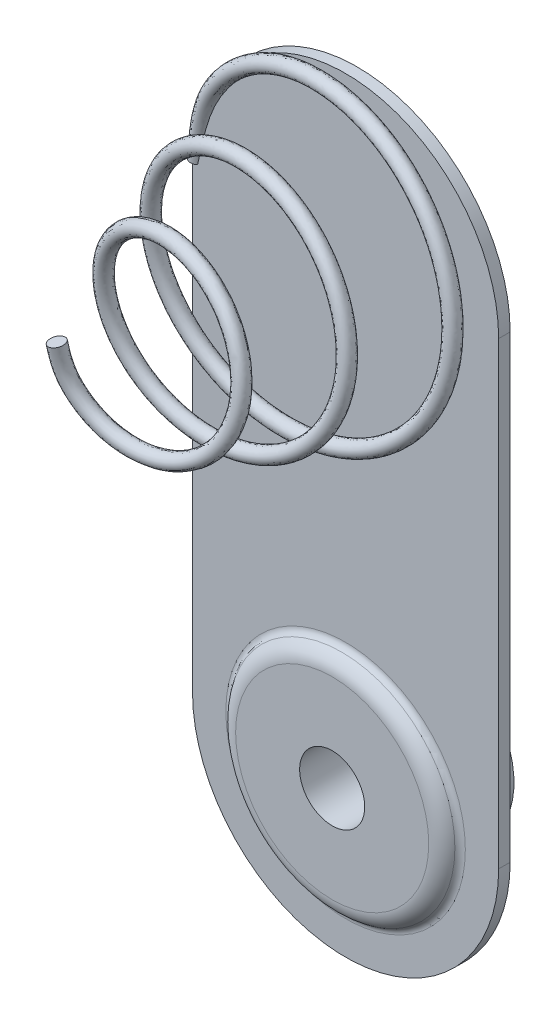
ISO-10303-21;
HEADER;
FILE_DESCRIPTION(('STEP AP214'),'2;1');
FILE_NAME('part.step','',(''),(''),'','','');
FILE_SCHEMA(('AUTOMOTIVE_DESIGN { 1 0 10303 214 1 1 1 1 }'));
ENDSEC;
DATA;
#1=APPLICATION_CONTEXT('core data for automotive mechanical design processes');
#2=APPLICATION_PROTOCOL_DEFINITION('international standard','automotive_design',2000,#1);
#3=PRODUCT_CONTEXT('',#1,'mechanical');
#4=PRODUCT('Part','Part','',(#3));
#5=PRODUCT_RELATED_PRODUCT_CATEGORY('part','',(#4));
#6=PRODUCT_DEFINITION_FORMATION('','',#4);
#7=PRODUCT_DEFINITION_CONTEXT('part definition',#1,'design');
#8=PRODUCT_DEFINITION('design','',#6,#7);
#9=PRODUCT_DEFINITION_SHAPE('','',#8);
#10=(LENGTH_UNIT() NAMED_UNIT(*) SI_UNIT(.MILLI.,.METRE.));
#11=(NAMED_UNIT(*) PLANE_ANGLE_UNIT() SI_UNIT($,.RADIAN.));
#12=(NAMED_UNIT(*) SI_UNIT($,.STERADIAN.) SOLID_ANGLE_UNIT());
#13=UNCERTAINTY_MEASURE_WITH_UNIT(LENGTH_MEASURE(1.E-05),#10,'distance_accuracy_value','');
#14=(GEOMETRIC_REPRESENTATION_CONTEXT(3) GLOBAL_UNCERTAINTY_ASSIGNED_CONTEXT((#13)) GLOBAL_UNIT_ASSIGNED_CONTEXT((#10,
#11,#12)) REPRESENTATION_CONTEXT('',''));
#15=CARTESIAN_POINT('',(0.,0.,0.));
#16=DIRECTION('',(0.,0.,1.));
#17=DIRECTION('',(1.,0.,0.));
#18=AXIS2_PLACEMENT_3D('',#15,#16,#17);
#19=CARTESIAN_POINT('',(0.,-12.,-2.));
#20=DIRECTION('',(0.,0.,1.));
#21=DIRECTION('',(1.,0.,0.));
#22=AXIS2_PLACEMENT_3D('',#19,#20,#21);
#23=CYLINDRICAL_SURFACE('',#22,1.);
#24=CARTESIAN_POINT('',(0.,-12.,-0.15));
#25=DIRECTION('',(0.,0.,1.));
#26=DIRECTION('',(1.,0.,0.));
#27=AXIS2_PLACEMENT_3D('',#24,#25,#26);
#28=CIRCLE('',#27,1.);
#29=CARTESIAN_POINT('',(1.,-12.,-0.15));
#30=VERTEX_POINT('',#29);
#31=EDGE_CURVE('E156',#30,#30,#28,.T.);
#32=ORIENTED_EDGE('',*,*,#31,.F.);
#33=EDGE_LOOP('',(#32));
#34=FACE_BOUND('',#33,.T.);
#35=CARTESIAN_POINT('',(0.,-12.,-1.8));
#36=DIRECTION('',(0.,0.,-1.));
#37=DIRECTION('',(-1.,0.,0.));
#38=AXIS2_PLACEMENT_3D('',#35,#36,#37);
#39=CIRCLE('',#38,1.);
#40=CARTESIAN_POINT('',(-1.,-12.,-1.8));
#41=VERTEX_POINT('',#40);
#42=EDGE_CURVE('E35',#41,#41,#39,.F.);
#43=ORIENTED_EDGE('',*,*,#42,.T.);
#44=EDGE_LOOP('',(#43));
#45=FACE_BOUND('',#44,.T.);
#46=ADVANCED_FACE('F31',(#34,#45),#23,.T.);
#47=CARTESIAN_POINT('',(0.,0.,0.15));
#48=DIRECTION('',(0.,0.,1.));
#49=DIRECTION('',(1.,0.,0.));
#50=AXIS2_PLACEMENT_3D('',#47,#48,#49);
#51=PLANE('',#50);
#52=CARTESIAN_POINT('',(0.,-12.,0.15));
#53=DIRECTION('',(0.,0.,1.));
#54=DIRECTION('',(1.,0.,0.));
#55=AXIS2_PLACEMENT_3D('',#52,#53,#54);
#56=CIRCLE('',#55,3.12924818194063);
#57=CARTESIAN_POINT('',(3.12924818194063,-12.,0.15));
#58=VERTEX_POINT('',#57);
#59=EDGE_CURVE('E40',#58,#58,#56,.F.);
#60=ORIENTED_EDGE('',*,*,#59,.T.);
#61=EDGE_LOOP('',(#60));
#62=FACE_BOUND('',#61,.T.);
#63=DIRECTION('',(1.,0.,0.));
#64=VECTOR('',#63,1.);
#65=CARTESIAN_POINT('',(-4.,0.,0.15));
#66=LINE('',#65,#64);
#67=CARTESIAN_POINT('',(-4.,0.,0.15));
#68=VERTEX_POINT('',#67);
#69=CARTESIAN_POINT('',(-3.86771243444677,0.,0.15));
#70=VERTEX_POINT('',#69);
#71=EDGE_CURVE('E106',#68,#70,#66,.T.);
#72=ORIENTED_EDGE('',*,*,#71,.F.);
#73=DIRECTION('',(0.,-1.,0.));
#74=VECTOR('',#73,1.);
#75=CARTESIAN_POINT('',(-4.,0.,0.15));
#76=LINE('',#75,#74);
#77=CARTESIAN_POINT('',(-4.,-12.,0.15));
#78=VERTEX_POINT('',#77);
#79=EDGE_CURVE('E99',#68,#78,#76,.T.);
#80=ORIENTED_EDGE('',*,*,#79,.T.);
#81=CARTESIAN_POINT('',(0.,-12.,0.15));
#82=DIRECTION('',(0.,0.,1.));
#83=DIRECTION('',(1.,0.,0.));
#84=AXIS2_PLACEMENT_3D('',#81,#82,#83);
#85=CIRCLE('',#84,4.);
#86=CARTESIAN_POINT('',(4.,-12.,0.15));
#87=VERTEX_POINT('',#86);
#88=EDGE_CURVE('E177',#78,#87,#85,.T.);
#89=ORIENTED_EDGE('',*,*,#88,.T.);
#90=DIRECTION('',(0.,1.,0.));
#91=VECTOR('',#90,1.);
#92=CARTESIAN_POINT('',(4.,0.,0.15));
#93=LINE('',#92,#91);
#94=CARTESIAN_POINT('',(4.,0.,0.15));
#95=VERTEX_POINT('',#94);
#96=EDGE_CURVE('E179',#87,#95,#93,.T.);
#97=ORIENTED_EDGE('',*,*,#96,.T.);
#98=CARTESIAN_POINT('',(0.,0.,0.15));
#99=DIRECTION('',(0.,0.,1.));
#100=DIRECTION('',(1.,0.,0.));
#101=AXIS2_PLACEMENT_3D('',#98,#99,#100);
#102=CIRCLE('',#101,4.);
#103=CARTESIAN_POINT('',(-2.26457137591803,3.29722860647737,0.15));
#104=VERTEX_POINT('',#103);
#105=EDGE_CURVE('E174',#95,#104,#102,.T.);
#106=ORIENTED_EDGE('',*,*,#105,.T.);
#107=CARTESIAN_POINT('',(-3.99999999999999,1.04414830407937,0.15));
#108=CARTESIAN_POINT('',(-3.99282968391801,1.07563880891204,0.150000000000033));
#109=CARTESIAN_POINT('',(-3.9853004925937,1.10704842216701,0.150000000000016));
#110=CARTESIAN_POINT('',(-3.96948688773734,1.16967342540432,0.149999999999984));
#111=CARTESIAN_POINT('',(-3.96120254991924,1.20088883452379,0.149999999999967));
#112=CARTESIAN_POINT('',(-3.94383414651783,1.26311941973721,0.150000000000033));
#113=CARTESIAN_POINT('',(-3.9347495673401,1.29413445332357,0.150000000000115));
#114=CARTESIAN_POINT('',(-3.91574353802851,1.35591189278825,0.149999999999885));
#115=CARTESIAN_POINT('',(-3.90582190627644,1.38667424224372,0.149999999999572));
#116=CARTESIAN_POINT('',(-3.8674718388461,1.5000262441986,0.149999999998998));
#117=CARTESIAN_POINT('',(-3.83628429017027,1.58171885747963,0.149999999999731));
#118=CARTESIAN_POINT('',(-3.76666571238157,1.74197543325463,0.150000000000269));
#119=CARTESIAN_POINT('',(-3.72823317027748,1.82053873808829,0.150000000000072));
#120=CARTESIAN_POINT('',(-3.64479141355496,1.97427386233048,0.149999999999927));
#121=CARTESIAN_POINT('',(-3.59976923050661,2.04943860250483,0.149999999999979));
#122=CARTESIAN_POINT('',(-3.50394634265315,2.19599716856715,0.150000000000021));
#123=CARTESIAN_POINT('',(-3.45314439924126,2.26739018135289,0.150000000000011));
#124=CARTESIAN_POINT('',(-3.34534686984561,2.40759393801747,0.149999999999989));
#125=CARTESIAN_POINT('',(-3.28824854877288,2.47632554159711,0.149999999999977));
#126=CARTESIAN_POINT('',(-3.16911728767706,2.60937089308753,0.150000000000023));
#127=CARTESIAN_POINT('',(-3.10708438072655,2.67368467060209,0.150000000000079));
#128=CARTESIAN_POINT('',(-2.9785127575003,2.79733523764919,0.149999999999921));
#129=CARTESIAN_POINT('',(-2.91198453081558,2.8566829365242,0.149999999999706));
#130=CARTESIAN_POINT('',(-2.774623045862,2.97013839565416,0.150000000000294));
#131=CARTESIAN_POINT('',(-2.7037913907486,3.02424808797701,0.150000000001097));
#132=CARTESIAN_POINT('',(-2.5908185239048,3.10363635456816,0.150000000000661));
#133=CARTESIAN_POINT('',(-2.55009031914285,3.13094288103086,0.150000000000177));
#134=CARTESIAN_POINT('',(-2.46740049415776,3.18363708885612,0.149999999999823));
#135=CARTESIAN_POINT('',(-2.42543878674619,3.209024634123,0.149999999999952));
#136=CARTESIAN_POINT('',(-2.3401579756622,3.25773727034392,0.150000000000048));
#137=CARTESIAN_POINT('',(-2.2968350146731,3.28105561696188,0.150000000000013));
#138=CARTESIAN_POINT('',(-2.20895349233,3.32520670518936,0.149999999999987));
#139=CARTESIAN_POINT('',(-2.16439558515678,3.3460407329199,0.149999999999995));
#140=CARTESIAN_POINT('',(-2.09651676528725,3.37498130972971,0.150000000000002));
#141=CARTESIAN_POINT('',(-2.07369083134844,3.38425212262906,0.150000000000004));
#142=CARTESIAN_POINT('',(-2.02766773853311,3.40186162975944,0.149999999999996));
#143=CARTESIAN_POINT('',(-2.00447040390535,3.41019986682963,0.149999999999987));
#144=CARTESIAN_POINT('',(-1.95782897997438,3.42563892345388,0.150000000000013));
#145=CARTESIAN_POINT('',(-1.93438760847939,3.43274770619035,0.150000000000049));
#146=CARTESIAN_POINT('',(-1.89886918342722,3.44208046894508,0.149999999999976));
#147=CARTESIAN_POINT('',(-1.88696719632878,3.44497022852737,0.14999999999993));
#148=CARTESIAN_POINT('',(-1.86303334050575,3.45013949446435,0.15000000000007));
#149=CARTESIAN_POINT('',(-1.85100157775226,3.4524194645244,0.150000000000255));
#150=CARTESIAN_POINT('',(-1.83087322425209,3.45540348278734,0.149999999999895));
#151=CARTESIAN_POINT('',(-1.82281702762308,3.45637968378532,0.149999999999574));
#152=CARTESIAN_POINT('',(-1.80666017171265,3.45768042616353,0.150000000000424));
#153=CARTESIAN_POINT('',(-1.79855973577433,3.4580070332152,0.150000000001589));
#154=CARTESIAN_POINT('',(-1.78639393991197,3.45753761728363,0.1500000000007));
#155=CARTESIAN_POINT('',(-1.7823156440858,3.45721719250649,0.149999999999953));
#156=CARTESIAN_POINT('',(-1.77424581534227,3.45604790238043,0.150000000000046));
#157=CARTESIAN_POINT('',(-1.77025394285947,3.45520177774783,0.150000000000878));
#158=CARTESIAN_POINT('',(-1.76332451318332,3.45277828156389,0.150000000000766));
#159=CARTESIAN_POINT('',(-1.76033650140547,3.45138243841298,0.150000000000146));
#160=CARTESIAN_POINT('',(-1.75610573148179,3.448213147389,0.14999999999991));
#161=CARTESIAN_POINT('',(-1.75462966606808,3.44678036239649,0.150000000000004));
#162=CARTESIAN_POINT('',(-1.7522854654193,3.44344941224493,0.149999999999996));
#163=CARTESIAN_POINT('',(-1.75142136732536,3.44154826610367,0.149999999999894));
#164=CARTESIAN_POINT('',(-1.7504835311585,3.43777716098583,0.150000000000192));
#165=CARTESIAN_POINT('',(-1.7503405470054,3.43592245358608,0.150000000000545));
#166=CARTESIAN_POINT('',(-1.75053843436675,3.43083224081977,0.150000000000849));
#167=CARTESIAN_POINT('',(-1.75133538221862,3.42763052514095,0.150000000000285));
#168=CARTESIAN_POINT('',(-1.75392554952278,3.42038001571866,0.149999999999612));
#169=CARTESIAN_POINT('',(-1.75597464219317,3.41644294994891,0.149999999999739));
#170=CARTESIAN_POINT('',(-1.76056678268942,3.4088483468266,0.150000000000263));
#171=CARTESIAN_POINT('',(-1.7631132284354,3.40519298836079,0.150000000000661));
#172=CARTESIAN_POINT('',(-1.77161395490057,3.39390439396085,0.150000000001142));
#173=CARTESIAN_POINT('',(-1.77805488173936,3.38664718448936,0.150000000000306));
#174=CARTESIAN_POINT('',(-1.79141476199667,3.37258203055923,0.149999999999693));
#175=CARTESIAN_POINT('',(-1.7983349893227,3.36577538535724,0.149999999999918));
#176=CARTESIAN_POINT('',(-1.81244888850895,3.3524394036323,0.150000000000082));
#177=CARTESIAN_POINT('',(-1.81964274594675,3.34591026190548,0.150000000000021));
#178=CARTESIAN_POINT('',(-1.83417691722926,3.33304198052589,0.149999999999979));
#179=CARTESIAN_POINT('',(-1.84151699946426,3.32670257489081,0.149999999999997));
#180=CARTESIAN_POINT('',(-1.86350453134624,3.30801691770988,0.150000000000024));
#181=CARTESIAN_POINT('',(-1.87829726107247,3.29584196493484,0.150000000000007));
#182=CARTESIAN_POINT('',(-1.90805516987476,3.27170417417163,0.149999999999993));
#183=CARTESIAN_POINT('',(-1.92302036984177,3.25974136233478,0.149999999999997));
#184=CARTESIAN_POINT('',(-1.96803929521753,3.22396299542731,0.150000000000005));
#185=CARTESIAN_POINT('',(-1.99819445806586,3.2002753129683,0.150000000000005));
#186=CARTESIAN_POINT('',(-2.05834933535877,3.15277813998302,0.149999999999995));
#187=CARTESIAN_POINT('',(-2.0883491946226,3.12896883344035,0.149999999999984));
#188=CARTESIAN_POINT('',(-2.1480599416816,3.08100161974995,0.150000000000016));
#189=CARTESIAN_POINT('',(-2.17777088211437,3.05684377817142,0.150000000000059));
#190=CARTESIAN_POINT('',(-2.26464960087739,2.98503221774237,0.150000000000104));
#191=CARTESIAN_POINT('',(-2.32127529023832,2.93671461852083,0.150000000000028));
#192=CARTESIAN_POINT('',(-2.43259833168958,2.83791014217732,0.149999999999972));
#193=CARTESIAN_POINT('',(-2.48729561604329,2.78742318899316,0.14999999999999));
#194=CARTESIAN_POINT('',(-2.64812587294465,2.63236190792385,0.15000000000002));
#195=CARTESIAN_POINT('',(-2.75092588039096,2.52424490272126,0.150000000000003));
#196=CARTESIAN_POINT('',(-2.89664927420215,2.35518057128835,0.149999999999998));
#197=CARTESIAN_POINT('',(-2.94373725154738,2.29778221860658,0.15));
#198=CARTESIAN_POINT('',(-3.03496530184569,2.18069150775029,0.15));
#199=CARTESIAN_POINT('',(-3.07910509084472,2.12099892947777,0.149999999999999));
#200=CARTESIAN_POINT('',(-3.20630314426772,1.93849194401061,0.150000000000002));
#201=CARTESIAN_POINT('',(-3.2843397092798,1.81202091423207,0.150000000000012));
#202=CARTESIAN_POINT('',(-3.37052220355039,1.64884301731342,0.149999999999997));
#203=CARTESIAN_POINT('',(-3.3869767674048,1.61640518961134,0.149999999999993));
#204=CARTESIAN_POINT('',(-3.41876164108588,1.55098309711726,0.150000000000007));
#205=CARTESIAN_POINT('',(-3.43409203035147,1.51799887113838,0.150000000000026));
#206=CARTESIAN_POINT('',(-3.47845311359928,1.4183285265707,0.149999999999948));
#207=CARTESIAN_POINT('',(-3.50585850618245,1.35091564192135,0.149999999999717));
#208=CARTESIAN_POINT('',(-3.5569040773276,1.21462750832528,0.150000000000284));
#209=CARTESIAN_POINT('',(-3.58054067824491,1.14575093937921,0.150000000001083));
#210=CARTESIAN_POINT('',(-3.62466132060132,1.00699862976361,0.149999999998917));
#211=CARTESIAN_POINT('',(-3.64514510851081,0.937122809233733,0.149999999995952));
#212=CARTESIAN_POINT('',(-3.69111190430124,0.769266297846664,0.14999999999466));
#213=CARTESIAN_POINT('',(-3.7154221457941,0.670969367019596,0.149999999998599));
#214=CARTESIAN_POINT('',(-3.76154048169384,0.473873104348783,0.150000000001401));
#215=CARTESIAN_POINT('',(-3.78334990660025,0.375074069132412,0.150000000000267));
#216=CARTESIAN_POINT('',(-3.81540232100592,0.230186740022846,0.149999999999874));
#217=CARTESIAN_POINT('',(-3.82561001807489,0.184091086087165,0.149999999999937));
#218=CARTESIAN_POINT('',(-3.84634571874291,0.0919734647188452,0.150000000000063));
#219=CARTESIAN_POINT('',(-3.85687371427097,0.0459514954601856,0.150000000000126));
#220=CARTESIAN_POINT('',(-3.86771243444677,0.,0.15));
#221=B_SPLINE_CURVE_WITH_KNOTS('',3,(#107,#108,#109,#110,#111,#112,#113,#114,#115,#116,#117,
#118,#119,#120,#121,#122,#123,#124,#125,#126,#127,#128,#129,#130,#131,#132,#133,#134,#135,#136,
#137,#138,#139,#140,#141,#142,#143,#144,#145,#146,#147,#148,#149,#150,#151,#152,#153,#154,#155,
#156,#157,#158,#159,#160,#161,#162,#163,#164,#165,#166,#167,#168,#169,#170,#171,#172,#173,#174,
#175,#176,#177,#178,#179,#180,#181,#182,#183,#184,#185,#186,#187,#188,#189,#190,#191,#192,#193,
#194,#195,#196,#197,#198,#199,#200,#201,#202,#203,#204,#205,#206,#207,#208,#209,#210,#211,#212,
#213,#214,#215,#216,#217,#218,#219,#220),.UNSPECIFIED.,.F.,.F.,(4,2,2,2,2,2,2,2,2,2,2,2,2,2,2,2,
2,2,2,2,2,2,2,2,2,2,2,2,2,2,2,2,2,2,2,2,2,2,2,2,2,2,2,2,2,2,2,2,2,2,2,2,2,2,2,2,4),(0.,
0.0968884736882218,0.193767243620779,0.290708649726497,0.387671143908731,0.649653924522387,
0.911691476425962,1.17425183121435,1.43686855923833,1.70468618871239,1.97250202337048,
2.23971317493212,2.50682538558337,2.65388739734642,2.80095982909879,2.94849525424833,
3.09595396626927,3.16984807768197,3.24377825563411,3.31721002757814,3.35394487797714,
3.39065171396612,3.41498736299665,3.4392455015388,3.45149819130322,3.46368753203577,
3.47342268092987,3.4794882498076,3.48559346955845,3.49109949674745,3.50083524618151,
3.51408741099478,3.52743349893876,3.55647093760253,3.58558875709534,3.61472668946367,
3.64382165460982,3.70129142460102,3.75876823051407,3.87380648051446,3.98870430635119,
4.10358079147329,4.32683989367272,4.55010683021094,4.99691530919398,5.21955531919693,
5.44221674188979,5.88663587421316,5.99574118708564,6.10483878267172,6.32300319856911,
6.54137349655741,6.75976134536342,7.06345712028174,7.36699056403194,7.50862683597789,
7.65025954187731),.UNSPECIFIED.);
#222=EDGE_CURVE('E56',#104,#70,#221,.T.);
#223=ORIENTED_EDGE('',*,*,#222,.T.);
#224=EDGE_LOOP('',(#72,#80,#89,#97,#106,#223));
#225=FACE_BOUND('',#224,.T.);
#226=ADVANCED_FACE('F140',(#62,#225),#51,.T.);
#227=CARTESIAN_POINT('',(-1.69681578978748,0.,5.99999999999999));
#228=DIRECTION('',(-0.190719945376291,0.975695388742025,0.107909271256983));
#229=DIRECTION('',(0.0461119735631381,-0.100901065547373,0.99382727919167));
#230=AXIS2_PLACEMENT_3D('',#227,#228,#229);
#231=PLANE('',#230);
#232=CARTESIAN_POINT('',(-1.69681578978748,0.,5.99999999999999));
#233=DIRECTION('',(-0.190719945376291,0.975695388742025,0.107909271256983));
#234=DIRECTION('',(0.0461119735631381,-0.100901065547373,0.99382727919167));
#235=AXIS2_PLACEMENT_3D('',#232,#233,#234);
#236=CIRCLE('',#235,0.2);
#237=CARTESIAN_POINT('',(-1.68759339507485,-0.0201802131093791,6.19876545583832));
#238=VERTEX_POINT('',#237);
#239=EDGE_CURVE('E108',#238,#238,#236,.T.);
#240=ORIENTED_EDGE('',*,*,#239,.T.);
#241=EDGE_LOOP('',(#240));
#242=FACE_BOUND('',#241,.T.);
#243=ADVANCED_FACE('F144',(#242),#231,.T.);
#244=CARTESIAN_POINT('',(-4.,0.,0.));
#245=DIRECTION('',(0.,1.,0.));
#246=DIRECTION('',(0.,0.,1.));
#247=AXIS2_PLACEMENT_3D('',#244,#245,#246);
#248=PLANE('',#247);
#249=DIRECTION('',(0.,0.,-1.));
#250=VECTOR('',#249,1.);
#251=CARTESIAN_POINT('',(-4.,0.,0.15));
#252=LINE('',#251,#250);
#253=CARTESIAN_POINT('',(-4.,0.,-0.15));
#254=VERTEX_POINT('',#253);
#255=EDGE_CURVE('E97',#68,#254,#252,.T.);
#256=ORIENTED_EDGE('',*,*,#255,.F.);
#257=ORIENTED_EDGE('',*,*,#71,.T.);
#258=CARTESIAN_POINT('',(-4.,0.,0.));
#259=DIRECTION('',(0.,1.,0.));
#260=DIRECTION('',(0.,0.,1.));
#261=AXIS2_PLACEMENT_3D('',#258,#259,#260);
#262=CIRCLE('',#261,0.2);
#263=CARTESIAN_POINT('',(-3.86771243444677,0.,-0.15));
#264=VERTEX_POINT('',#263);
#265=EDGE_CURVE('E105',#264,#70,#262,.T.);
#266=ORIENTED_EDGE('',*,*,#265,.F.);
#267=DIRECTION('',(1.,0.,0.));
#268=VECTOR('',#267,1.);
#269=CARTESIAN_POINT('',(-4.,0.,-0.15));
#270=LINE('',#269,#268);
#271=EDGE_CURVE('E48',#254,#264,#270,.T.);
#272=ORIENTED_EDGE('',*,*,#271,.F.);
#273=EDGE_LOOP('',(#256,#257,#266,#272));
#274=FACE_BOUND('',#273,.T.);
#275=ADVANCED_FACE('F33',(#274),#248,.F.);
#276=CARTESIAN_POINT('',(-4.,0.,0.2));
#277=CARTESIAN_POINT('',(-3.95955414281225,0.278530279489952,0.22231873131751));
#278=CARTESIAN_POINT('',(-3.88019416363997,0.831714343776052,0.266636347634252));
#279=CARTESIAN_POINT('',(-3.63186594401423,1.63967999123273,0.33515891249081));
#280=CARTESIAN_POINT('',(-3.17585543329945,2.35401811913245,0.403186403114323));
#281=CARTESIAN_POINT('',(-2.57881752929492,2.95453459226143,0.471251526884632));
#282=CARTESIAN_POINT('',(-1.8694536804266,3.41853640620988,0.540499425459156));
#283=CARTESIAN_POINT('',(-1.07763703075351,3.7169636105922,0.610139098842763));
#284=CARTESIAN_POINT('',(-0.239708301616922,3.83635074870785,0.680021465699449));
#285=CARTESIAN_POINT('',(0.604434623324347,3.76840666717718,0.750499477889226));
#286=CARTESIAN_POINT('',(1.41293679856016,3.51674324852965,0.821507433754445));
#287=CARTESIAN_POINT('',(2.14482614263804,3.09100035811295,0.892996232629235));
#288=CARTESIAN_POINT('',(2.7635727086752,2.51298302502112,0.96502426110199));
#289=CARTESIAN_POINT('',(3.22775405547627,1.82173380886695,1.03635330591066));
#290=CARTESIAN_POINT('',(3.52203069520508,1.05905829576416,1.1069765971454));
#291=CARTESIAN_POINT('',(3.64188736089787,0.264691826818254,1.17685270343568));
#292=CARTESIAN_POINT('',(3.58434158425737,-0.536572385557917,1.24726413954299));
#293=CARTESIAN_POINT('',(3.3524923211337,-1.30575421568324,1.31819259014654));
#294=CARTESIAN_POINT('',(2.95473931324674,-2.00378317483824,1.38966023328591));
#295=CARTESIAN_POINT('',(2.41158475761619,-2.5957288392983,1.46169312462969));
#296=CARTESIAN_POINT('',(1.74856085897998,-3.04955487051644,1.53426884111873));
#297=CARTESIAN_POINT('',(0.99987177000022,-3.34100716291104,1.60745051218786));
#298=CARTESIAN_POINT('',(0.204299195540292,-3.4536226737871,1.68120053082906));
#299=CARTESIAN_POINT('',(-0.595715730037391,-3.37885024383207,1.75557237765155));
#300=CARTESIAN_POINT('',(-1.35663811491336,-3.12074226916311,1.83056704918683));
#301=CARTESIAN_POINT('',(-2.03548153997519,-2.69069885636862,1.90618545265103));
#302=CARTESIAN_POINT('',(-2.59341536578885,-2.11243398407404,1.9824822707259));
#303=CARTESIAN_POINT('',(-2.99752872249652,-1.41778085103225,2.05943085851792));
#304=CARTESIAN_POINT('',(-3.22190496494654,-0.646127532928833,2.13707338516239));
#305=CARTESIAN_POINT('',(-3.25161239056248,0.127464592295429,2.21256402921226));
#306=CARTESIAN_POINT('',(-3.10699729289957,0.855979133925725,2.28571262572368));
#307=CARTESIAN_POINT('',(-2.81761493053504,1.50790160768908,2.35658192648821));
#308=CARTESIAN_POINT('',(-2.39099870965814,2.07952927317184,2.42802660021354));
#309=CARTESIAN_POINT('',(-1.84686186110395,2.54069240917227,2.50011159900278));
#310=CARTESIAN_POINT('',(-1.21301058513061,2.86777358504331,2.57282750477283));
#311=CARTESIAN_POINT('',(-0.5211081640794,3.04122326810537,2.64619065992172));
#312=CARTESIAN_POINT('',(0.192083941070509,3.0515155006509,2.72024628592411));
#313=CARTESIAN_POINT('',(0.888273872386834,2.89605399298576,2.79496729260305));
#314=CARTESIAN_POINT('',(1.52858106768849,2.58171231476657,2.87042224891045));
#315=CARTESIAN_POINT('',(2.07688154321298,2.12543639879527,2.94659753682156));
#316=CARTESIAN_POINT('',(2.50009608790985,1.5511735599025,3.02352034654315));
#317=CARTESIAN_POINT('',(2.77279333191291,0.892036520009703,3.10123988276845));
#318=CARTESIAN_POINT('',(2.87713019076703,0.186353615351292,3.17973051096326));
#319=CARTESIAN_POINT('',(2.80692690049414,-0.497262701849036,3.25615512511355));
#320=CARTESIAN_POINT('',(2.58805098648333,-1.11904809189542,3.33033128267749));
#321=CARTESIAN_POINT('',(2.24949422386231,-1.65401623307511,3.40224583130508));
#322=CARTESIAN_POINT('',(1.79919582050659,-2.09892721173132,3.47489438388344));
#323=CARTESIAN_POINT('',(1.25947859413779,-2.42976811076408,3.54825053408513));
#324=CARTESIAN_POINT('',(0.658030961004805,-2.6272073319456,3.62238413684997));
#325=CARTESIAN_POINT('',(0.0272463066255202,-2.68003573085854,3.69728969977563));
#326=CARTESIAN_POINT('',(-0.598271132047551,-2.58284850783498,3.77299294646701));
#327=CARTESIAN_POINT('',(-1.18288773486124,-2.34022520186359,3.84954880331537));
#328=CARTESIAN_POINT('',(-1.69234220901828,-1.96455269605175,3.92693978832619));
#329=CARTESIAN_POINT('',(-2.09514081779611,-1.47627936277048,4.00523504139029));
#330=CARTESIAN_POINT('',(-2.36618506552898,-0.904334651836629,4.08445252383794));
#331=CARTESIAN_POINT('',(-2.48668149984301,-0.282956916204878,4.16460469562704));
#332=CARTESIAN_POINT('',(-2.44705540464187,0.34874042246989,4.24576909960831));
#333=CARTESIAN_POINT('',(-2.24852248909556,0.949592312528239,4.32793691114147));
#334=CARTESIAN_POINT('',(-1.93033490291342,1.43531523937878,4.4042982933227));
#335=CARTESIAN_POINT('',(-1.54979578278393,1.79689934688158,4.47442894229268));
#336=CARTESIAN_POINT('',(-1.14937720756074,2.04834591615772,4.53822010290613));
#337=CARTESIAN_POINT('',(-0.706628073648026,2.21405008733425,4.60269570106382));
#338=CARTESIAN_POINT('',(-0.239605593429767,2.28696946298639,4.66782485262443));
#339=CARTESIAN_POINT('',(0.232399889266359,2.26230722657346,4.73368666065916));
#340=CARTESIAN_POINT('',(0.689124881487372,2.14096549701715,4.8002500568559));
#341=CARTESIAN_POINT('',(1.11009509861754,1.92630368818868,4.8675858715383));
#342=CARTESIAN_POINT('',(1.47634963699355,1.62787147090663,4.93568569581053));
#343=CARTESIAN_POINT('',(1.76987626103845,1.25770088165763,5.00459422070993));
#344=CARTESIAN_POINT('',(1.97645661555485,0.832957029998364,5.07434448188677));
#345=CARTESIAN_POINT('',(2.08484953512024,0.373315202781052,5.14493689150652));
#346=CARTESIAN_POINT('',(2.08828640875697,-0.0815187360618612,5.21383128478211));
#347=CARTESIAN_POINT('',(1.99896994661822,-0.508696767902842,5.28081616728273));
#348=CARTESIAN_POINT('',(1.83174079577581,-0.892925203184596,5.34594136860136));
#349=CARTESIAN_POINT('',(1.58967030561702,-1.23482790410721,5.41181809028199));
#350=CARTESIAN_POINT('',(1.281728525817,-1.51878461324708,5.47854763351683));
#351=CARTESIAN_POINT('',(0.921425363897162,-1.732116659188,5.5460873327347));
#352=CARTESIAN_POINT('',(0.523884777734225,-1.86350543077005,5.61455451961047));
#353=CARTESIAN_POINT('',(0.107425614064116,-1.90625636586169,5.68394297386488));
#354=CARTESIAN_POINT('',(-0.308113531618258,-1.85744169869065,5.75418312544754));
#355=CARTESIAN_POINT('',(-0.70276124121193,-1.71905175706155,5.82544460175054));
#356=CARTESIAN_POINT('',(-1.05384131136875,-1.49083706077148,5.89815976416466));
#357=CARTESIAN_POINT('',(-1.34684599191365,-1.19313319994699,5.97139603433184));
#358=CARTESIAN_POINT('',(-1.57409379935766,-0.840994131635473,6.04504905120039));
#359=CARTESIAN_POINT('',(-1.67196014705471,-0.433928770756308,6.12242305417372));
#360=CARTESIAN_POINT('',(-1.68138576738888,-0.158676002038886,6.17320315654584));
#361=CARTESIAN_POINT('',(-1.68759339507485,-0.0201802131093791,6.19876545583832));
#362=CARTESIAN_POINT('',(-3.6,0.,0.2));
#363=CARTESIAN_POINT('',(-3.55951483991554,0.278800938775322,0.222340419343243));
#364=CARTESIAN_POINT('',(-3.47849824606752,0.816170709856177,0.265779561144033));
#365=CARTESIAN_POINT('',(-3.24385775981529,1.52418171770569,0.3251039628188));
#366=CARTESIAN_POINT('',(-2.8299265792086,2.14690012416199,0.395710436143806));
#367=CARTESIAN_POINT('',(-2.28147475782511,2.68305671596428,0.467385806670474));
#368=CARTESIAN_POINT('',(-1.63562609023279,3.08999739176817,0.534510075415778));
#369=CARTESIAN_POINT('',(-0.922714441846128,3.34471341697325,0.603503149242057));
#370=CARTESIAN_POINT('',(-0.168582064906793,3.43949322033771,0.674353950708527));
#371=CARTESIAN_POINT('',(0.585833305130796,3.36552080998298,0.744727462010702));
#372=CARTESIAN_POINT('',(1.30592116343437,3.12793259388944,0.815529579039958));
#373=CARTESIAN_POINT('',(1.95384209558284,2.73565748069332,0.887352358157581));
#374=CARTESIAN_POINT('',(2.4972567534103,2.21000690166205,0.959155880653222));
#375=CARTESIAN_POINT('',(2.90127295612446,1.58493039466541,1.03085118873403));
#376=CARTESIAN_POINT('',(3.15115608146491,0.90095927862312,1.10124479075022));
#377=CARTESIAN_POINT('',(3.24561741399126,0.190235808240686,1.17140195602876));
#378=CARTESIAN_POINT('',(3.18133068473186,-0.521321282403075,1.24174615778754));
#379=CARTESIAN_POINT('',(2.96272341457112,-1.20225425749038,1.31270041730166));
#380=CARTESIAN_POINT('',(2.59778063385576,-1.81581585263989,1.38438833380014));
#381=CARTESIAN_POINT('',(2.10626186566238,-2.33210199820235,1.45619730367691));
#382=CARTESIAN_POINT('',(1.51012483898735,-2.72403536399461,1.52917377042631));
#383=CARTESIAN_POINT('',(0.84283776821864,-2.9692691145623,1.60213166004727));
#384=CARTESIAN_POINT('',(0.136030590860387,-3.05587189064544,1.67613218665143));
#385=CARTESIAN_POINT('',(-0.569346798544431,-2.97599211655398,1.75055547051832));
#386=CARTESIAN_POINT('',(-1.23681777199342,-2.7352604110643,1.8254023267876));
#387=CARTESIAN_POINT('',(-1.82859039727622,-2.34389968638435,1.90142199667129));
#388=CARTESIAN_POINT('',(-2.30939562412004,-1.82530910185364,1.97751058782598));
#389=CARTESIAN_POINT('',(-2.65337081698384,-1.2064064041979,2.05468284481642));
#390=CARTESIAN_POINT('',(-2.83655323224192,-0.524534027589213,2.13246154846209));
#391=CARTESIAN_POINT('',(-2.84893327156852,0.154525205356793,2.20774741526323));
#392=CARTESIAN_POINT('',(-2.70891302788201,0.791373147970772,2.28133895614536));
#393=CARTESIAN_POINT('',(-2.44400151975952,1.35595715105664,2.3519619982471));
#394=CARTESIAN_POINT('',(-2.06005946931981,1.84891216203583,2.42371742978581));
#395=CARTESIAN_POINT('',(-1.57672945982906,2.24096902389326,2.49580851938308));
#396=CARTESIAN_POINT('',(-1.01761838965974,2.51477939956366,2.56843391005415));
#397=CARTESIAN_POINT('',(-0.411490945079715,2.65276312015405,2.64220536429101));
#398=CARTESIAN_POINT('',(0.208382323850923,2.64822348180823,2.71597745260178));
#399=CARTESIAN_POINT('',(0.811053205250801,2.49979634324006,2.79113188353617));
#400=CARTESIAN_POINT('',(1.35953040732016,2.21496764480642,2.86651374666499));
#401=CARTESIAN_POINT('',(1.82593219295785,1.80906620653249,2.94266192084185));
#402=CARTESIAN_POINT('',(2.18054163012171,1.30398394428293,3.01999530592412));
#403=CARTESIAN_POINT('',(2.40260899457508,0.730199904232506,3.09747919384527));
#404=CARTESIAN_POINT('',(2.47867560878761,0.119104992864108,3.17630547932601));
#405=CARTESIAN_POINT('',(2.40424286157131,-0.467148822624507,3.2528736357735));
#406=CARTESIAN_POINT('',(2.20373007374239,-0.996657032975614,3.32680913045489));
#407=CARTESIAN_POINT('',(1.90206368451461,-1.44884796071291,3.39928886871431));
#408=CARTESIAN_POINT('',(1.50787958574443,-1.81972156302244,3.47161502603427));
#409=CARTESIAN_POINT('',(1.03895273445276,-2.09176316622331,3.54542504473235));
#410=CARTESIAN_POINT('',(0.522360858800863,-2.24696990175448,3.61954740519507));
#411=CARTESIAN_POINT('',(-0.0162045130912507,-2.27867871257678,3.69436501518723));
#412=CARTESIAN_POINT('',(-0.545830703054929,-2.18237688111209,3.7705960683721));
#413=CARTESIAN_POINT('',(-1.0357306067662,-1.96407689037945,3.84686566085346));
#414=CARTESIAN_POINT('',(-1.45942783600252,-1.63446298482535,3.9246924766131));
#415=CARTESIAN_POINT('',(-1.78820114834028,-1.21332281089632,4.00310752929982));
#416=CARTESIAN_POINT('',(-2.0037757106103,-0.72541895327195,4.08213088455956));
#417=CARTESIAN_POINT('',(-2.09104643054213,-0.199591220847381,4.16287007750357));
#418=CARTESIAN_POINT('',(-2.0430719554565,0.328697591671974,4.24402831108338));
#419=CARTESIAN_POINT('',(-1.86309097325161,0.826932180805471,4.32603322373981));
#420=CARTESIAN_POINT('',(-1.58568499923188,1.22518767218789,4.40313891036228));
#421=CARTESIAN_POINT('',(-1.26089441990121,1.51642716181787,4.47286372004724));
#422=CARTESIAN_POINT('',(-0.921417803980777,1.71633088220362,4.53732322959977));
#423=CARTESIAN_POINT('',(-0.551298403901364,1.84242155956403,4.60142449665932));
#424=CARTESIAN_POINT('',(-0.162219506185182,1.89162202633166,4.66718351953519));
#425=CARTESIAN_POINT('',(0.225590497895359,1.85944879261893,4.73278313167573));
#426=CARTESIAN_POINT('',(0.599555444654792,1.74807513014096,4.79982608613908));
#427=CARTESIAN_POINT('',(0.938872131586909,1.56141526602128,4.86714083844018));
#428=CARTESIAN_POINT('',(1.23194056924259,1.30732321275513,4.9353972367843));
#429=CARTESIAN_POINT('',(1.46164388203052,0.997720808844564,5.00472025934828));
#430=CARTESIAN_POINT('',(1.61902493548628,0.646294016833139,5.07407040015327));
#431=CARTESIAN_POINT('',(1.69490395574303,0.269981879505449,5.14561626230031));
#432=CARTESIAN_POINT('',(1.68556260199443,-0.097730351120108,5.21395442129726));
#433=CARTESIAN_POINT('',(1.6019093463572,-0.44094193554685,5.28188340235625));
#434=CARTESIAN_POINT('',(1.45713219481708,-0.744755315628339,5.34649300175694));
#435=CARTESIAN_POINT('',(1.25309844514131,-1.01330146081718,5.41324016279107));
#436=CARTESIAN_POINT('',(0.999581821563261,-1.23102862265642,5.47957722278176));
#437=CARTESIAN_POINT('',(0.705611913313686,-1.39169290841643,5.54794103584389));
#438=CARTESIAN_POINT('',(0.386918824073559,-1.4843036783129,5.61628422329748));
#439=CARTESIAN_POINT('',(0.0552941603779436,-1.50642343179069,5.68536293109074));
#440=CARTESIAN_POINT('',(-0.270497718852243,-1.4558204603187,5.7568016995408));
#441=CARTESIAN_POINT('',(-0.575832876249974,-1.33601367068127,5.83005382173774));
#442=CARTESIAN_POINT('',(-0.843179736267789,-1.1469112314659,5.89790568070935));
#443=CARTESIAN_POINT('',(-1.06757017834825,-0.902397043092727,5.97248945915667));
#444=CARTESIAN_POINT('',(-1.22890261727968,-0.62705266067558,6.05895592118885));
#445=CARTESIAN_POINT('',(-1.28050659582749,-0.335986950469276,6.11647968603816));
#446=CARTESIAN_POINT('',(-1.28914787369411,-0.0811709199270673,6.16284839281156));
#447=CARTESIAN_POINT('',(-1.2953690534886,0.0576272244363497,6.18846649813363));
#448=CARTESIAN_POINT('',(-3.6,0.,-0.2));
#449=CARTESIAN_POINT('',(-3.55951483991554,0.278800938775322,-0.177659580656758));
#450=CARTESIAN_POINT('',(-3.47949589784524,0.81633197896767,-0.134242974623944));
#451=CARTESIAN_POINT('',(-3.25303768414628,1.52906590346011,-0.0747781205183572));
#452=CARTESIAN_POINT('',(-2.83536203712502,2.15240526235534,-0.00421849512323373));
#453=CARTESIAN_POINT('',(-2.28339906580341,2.68676146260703,0.067403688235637));
#454=CARTESIAN_POINT('',(-1.63747736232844,3.09613944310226,0.134560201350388));
#455=CARTESIAN_POINT('',(-0.923046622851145,3.35182718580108,0.203565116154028));
#456=CARTESIAN_POINT('',(-0.167133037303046,3.44556976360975,0.274401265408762));
#457=CARTESIAN_POINT('',(0.588810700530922,3.37123409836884,0.344778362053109));
#458=CARTESIAN_POINT('',(1.31046355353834,3.13294864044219,0.415585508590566));
#459=CARTESIAN_POINT('',(1.95937758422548,2.7391692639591,0.487404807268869));
#460=CARTESIAN_POINT('',(2.50381802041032,2.21214036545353,0.559214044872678));
#461=CARTESIAN_POINT('',(2.90796705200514,1.58518694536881,0.630905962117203));
#462=CARTESIAN_POINT('',(3.15805455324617,0.899552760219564,0.701305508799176));
#463=CARTESIAN_POINT('',(3.25182027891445,0.187078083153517,0.771461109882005));
#464=CARTESIAN_POINT('',(3.18674217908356,-0.526012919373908,0.841809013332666));
#465=CARTESIAN_POINT('',(2.96685963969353,-1.2083188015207,0.912766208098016));
#466=CARTESIAN_POINT('',(2.60017475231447,-1.82273315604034,0.98445388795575));
#467=CARTESIAN_POINT('',(2.10697385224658,-2.33978571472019,1.0562700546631));
#468=CARTESIAN_POINT('',(1.50867308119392,-2.73149880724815,1.1292442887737));
#469=CARTESIAN_POINT('',(0.839506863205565,-2.97652592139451,1.20220969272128));
#470=CARTESIAN_POINT('',(0.130782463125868,-3.06198210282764,1.27621120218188));
#471=CARTESIAN_POINT('',(-0.576124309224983,-2.98065059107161,1.35063830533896));
#472=CARTESIAN_POINT('',(-1.2449118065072,-2.7382255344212,1.42549289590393));
#473=CARTESIAN_POINT('',(-1.83717219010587,-2.34441018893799,1.50151208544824));
#474=CARTESIAN_POINT('',(-2.31824660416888,-1.82365359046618,1.57760974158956));
#475=CARTESIAN_POINT('',(-2.66157042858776,-1.20226115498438,1.65478548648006));
#476=CARTESIAN_POINT('',(-2.84346628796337,-0.518217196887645,1.73256881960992));
#477=CARTESIAN_POINT('',(-2.85437526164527,0.162700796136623,1.80786511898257));
#478=CARTESIAN_POINT('',(-2.71188299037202,0.800758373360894,1.88145759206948));
#479=CARTESIAN_POINT('',(-2.44489216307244,1.36619605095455,1.95209159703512));
#480=CARTESIAN_POINT('',(-2.05821248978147,1.85920356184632,2.02385098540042));
#481=CARTESIAN_POINT('',(-1.57237279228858,2.25077924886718,2.09595005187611));
#482=CARTESIAN_POINT('',(-1.01081020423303,2.52363906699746,2.16858643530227));
#483=CARTESIAN_POINT('',(-0.402451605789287,2.65952458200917,2.24236135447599));
#484=CARTESIAN_POINT('',(0.219173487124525,2.65299789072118,2.31614795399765));
#485=CARTESIAN_POINT('',(0.822937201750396,2.50145298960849,2.39130751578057));
#486=CARTESIAN_POINT('',(1.37183688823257,2.21367831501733,2.4667016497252));
#487=CARTESIAN_POINT('',(1.83798763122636,1.80461146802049,2.54286337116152));
#488=CARTESIAN_POINT('',(2.19107109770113,1.29624765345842,2.62020394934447));
#489=CARTESIAN_POINT('',(2.41134687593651,0.719786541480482,2.69770530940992));
#490=CARTESIAN_POINT('',(2.48436760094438,0.106356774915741,2.77654271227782));
#491=CARTESIAN_POINT('',(2.40655204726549,-0.481234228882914,2.85312381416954));
#492=CARTESIAN_POINT('',(2.20276538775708,-1.01147510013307,2.9270791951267));
#493=CARTESIAN_POINT('',(1.89715315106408,-1.46309816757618,2.99956728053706));
#494=CARTESIAN_POINT('',(1.49972522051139,-1.83305676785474,3.07191491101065));
#495=CARTESIAN_POINT('',(1.02734839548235,-2.10277660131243,3.14573789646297));
#496=CARTESIAN_POINT('',(0.508109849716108,-2.25513805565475,3.21987899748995));
#497=CARTESIAN_POINT('',(-0.0325537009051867,-2.28345081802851,3.29471953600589));
#498=CARTESIAN_POINT('',(-0.563194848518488,-2.18258605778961,3.3709651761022));
#499=CARTESIAN_POINT('',(-1.05328246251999,-1.96016416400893,3.44726192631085));
#500=CARTESIAN_POINT('',(-1.47574059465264,-1.6257786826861,3.52510906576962));
#501=CARTESIAN_POINT('',(-1.8021237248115,-1.20045227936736,3.60354833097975));
#502=CARTESIAN_POINT('',(-2.01456393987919,-0.708972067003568,3.68260338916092));
#503=CARTESIAN_POINT('',(-2.09694863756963,-0.180299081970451,3.76336601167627));
#504=CARTESIAN_POINT('',(-2.04386880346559,0.349432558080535,3.84455613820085));
#505=CARTESIAN_POINT('',(-1.85845729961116,0.847990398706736,3.92659898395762));
#506=CARTESIAN_POINT('',(-1.57532420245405,1.24453168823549,4.0037301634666));
#507=CARTESIAN_POINT('',(-1.24635507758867,1.53370503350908,4.07349232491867));
#508=CARTESIAN_POINT('',(-0.902984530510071,1.73013250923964,4.13797669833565));
#509=CARTESIAN_POINT('',(-0.530008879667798,1.85274141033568,4.20211448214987));
#510=CARTESIAN_POINT('',(-0.138634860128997,1.89694063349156,4.26790322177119));
#511=CARTESIAN_POINT('',(0.250387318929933,1.85997815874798,4.33354138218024));
#512=CARTESIAN_POINT('',(0.624438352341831,1.74288462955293,4.40062081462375));
#513=CARTESIAN_POINT('',(0.962634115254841,1.55081389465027,4.46797539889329));
#514=CARTESIAN_POINT('',(1.25342327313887,1.29136056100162,4.53627731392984));
#515=CARTESIAN_POINT('',(1.47921343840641,0.976787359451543,4.60564078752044));
#516=CARTESIAN_POINT('',(1.63236309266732,0.621441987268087,4.6750475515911));
#517=CARTESIAN_POINT('',(1.70168286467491,0.24199089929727,4.74663592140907));
#518=CARTESIAN_POINT('',(1.68667277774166,-0.127339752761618,4.81503490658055));
#519=CARTESIAN_POINT('',(1.59582381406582,-0.470571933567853,4.88301153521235));
#520=CARTESIAN_POINT('',(1.44523706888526,-0.773441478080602,4.94768229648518));
#521=CARTESIAN_POINT('',(1.23450336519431,-1.03906487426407,5.01448390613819));
#522=CARTESIAN_POINT('',(0.97563559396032,-1.25313249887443,5.08088640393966));
#523=CARTESIAN_POINT('',(0.67645409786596,-1.4080444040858,5.14931535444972));
#524=CARTESIAN_POINT('',(0.354193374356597,-1.49434821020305,5.21773170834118));
#525=CARTESIAN_POINT('',(0.0202132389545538,-1.50962800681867,5.2868911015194));
#526=CARTESIAN_POINT('',(-0.306149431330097,-1.44988024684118,5.35839277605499));
#527=CARTESIAN_POINT('',(-0.609354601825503,-1.32014698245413,5.43175038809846));
#528=CARTESIAN_POINT('',(-0.875993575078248,-1.12726377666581,5.4997499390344));
#529=CARTESIAN_POINT('',(-1.09500130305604,-0.87426646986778,5.57426740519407));
#530=CARTESIAN_POINT('',(-1.23789532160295,-0.586870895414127,5.66099361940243));
#531=CARTESIAN_POINT('',(-1.29669462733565,-0.296221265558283,5.71879500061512));
#532=CARTESIAN_POINT('',(-1.30759266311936,-0.0408104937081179,5.76531748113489));
#533=CARTESIAN_POINT('',(-1.31381384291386,0.0979876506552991,5.79093558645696));
#534=CARTESIAN_POINT('',(-4.,0.,-0.2));
#535=CARTESIAN_POINT('',(-3.9595344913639,0.278665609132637,-0.177670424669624));
#536=CARTESIAN_POINT('',(-3.88120079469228,0.831813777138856,-0.133391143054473));
#537=CARTESIAN_POINT('',(-3.64104345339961,1.64458080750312,-0.0647218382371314));
#538=CARTESIAN_POINT('',(-3.18129154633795,2.35951874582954,0.0032571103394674));
#539=CARTESIAN_POINT('',(-2.58074166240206,2.95824054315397,0.0712695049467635));
#540=CARTESIAN_POINT('',(-1.87130499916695,3.4246781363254,0.140549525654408));
#541=CARTESIAN_POINT('',(-1.07796919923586,3.72407746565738,0.210201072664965));
#542=CARTESIAN_POINT('',(-0.238259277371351,3.84242726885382,0.280068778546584));
#543=CARTESIAN_POINT('',(0.607412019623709,3.77411996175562,0.350550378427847));
#544=CARTESIAN_POINT('',(1.41747918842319,3.52175929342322,0.421563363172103));
#545=CARTESIAN_POINT('',(2.15036163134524,3.09451214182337,0.493048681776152));
#546=CARTESIAN_POINT('',(2.77013397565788,2.51511648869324,0.565082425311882));
#547=CARTESIAN_POINT('',(3.23444815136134,1.82199035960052,0.636408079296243));
#548=CARTESIAN_POINT('',(3.5289291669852,1.05765177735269,0.707037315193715));
#549=CARTESIAN_POINT('',(3.64809022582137,0.261534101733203,0.776911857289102));
#550=CARTESIAN_POINT('',(3.58975307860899,-0.541264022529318,0.847326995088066));
#551=CARTESIAN_POINT('',(3.35662854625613,-1.3118187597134,0.918258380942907));
#552=CARTESIAN_POINT('',(2.95713343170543,-2.01070047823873,0.989725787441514));
#553=CARTESIAN_POINT('',(2.41229674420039,-2.60341255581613,1.06176587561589));
#554=CARTESIAN_POINT('',(1.74710910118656,-3.05701831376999,1.13433935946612));
#555=CARTESIAN_POINT('',(0.996540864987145,-3.34826396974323,1.20752854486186));
#556=CARTESIAN_POINT('',(0.199051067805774,-3.4597328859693,1.28127954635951));
#557=CARTESIAN_POINT('',(-0.602493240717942,-3.38350871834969,1.35565521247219));
#558=CARTESIAN_POINT('',(-1.36473214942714,-3.12370739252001,1.43065761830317));
#559=CARTESIAN_POINT('',(-2.04406333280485,-2.69120935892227,1.50627554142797));
#560=CARTESIAN_POINT('',(-2.60226634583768,-2.11077847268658,1.58258142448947));
#561=CARTESIAN_POINT('',(-3.00572833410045,-1.41363560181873,1.65953350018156));
#562=CARTESIAN_POINT('',(-3.22881802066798,-0.639810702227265,1.73718065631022));
#563=CARTESIAN_POINT('',(-3.25705438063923,0.135640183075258,1.8126817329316));
#564=CARTESIAN_POINT('',(-3.10996725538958,0.865364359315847,1.8858312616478));
#565=CARTESIAN_POINT('',(-2.81850557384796,1.51814050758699,1.95671152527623));
#566=CARTESIAN_POINT('',(-2.3891517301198,2.08982067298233,2.02816015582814));
#567=CARTESIAN_POINT('',(-1.84250519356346,2.5505026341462,2.10025313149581));
#568=CARTESIAN_POINT('',(-1.20620239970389,2.87663325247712,2.17298003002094));
#569=CARTESIAN_POINT('',(-0.512068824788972,3.04798472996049,2.24634665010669));
#570=CARTESIAN_POINT('',(0.202875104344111,3.05628990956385,2.32041678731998));
#571=CARTESIAN_POINT('',(0.900157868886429,2.89771063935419,2.39514292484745));
#572=CARTESIAN_POINT('',(1.5408875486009,2.58042298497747,2.47061015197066));
#573=CARTESIAN_POINT('',(2.08893698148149,2.12098166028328,2.54679898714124));
#574=CARTESIAN_POINT('',(2.51062555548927,1.54343726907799,2.6237289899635));
#575=CARTESIAN_POINT('',(2.78153121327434,0.881623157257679,2.7014659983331));
#576=CARTESIAN_POINT('',(2.8828221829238,0.173605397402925,2.77996774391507));
#577=CARTESIAN_POINT('',(2.80923608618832,-0.511348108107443,2.85640530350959));
#578=CARTESIAN_POINT('',(2.58708630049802,-1.13386615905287,2.93060134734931));
#579=CARTESIAN_POINT('',(2.24458369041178,-1.66826643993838,3.00252424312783));
#580=CARTESIAN_POINT('',(1.79104145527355,-2.11226241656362,3.07519426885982));
#581=CARTESIAN_POINT('',(1.24787425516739,-2.4407815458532,3.14856338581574));
#582=CARTESIAN_POINT('',(0.643779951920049,-2.63537548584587,3.22271572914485));
#583=CARTESIAN_POINT('',(0.0108971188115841,-2.68480783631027,3.2976442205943));
#584=CARTESIAN_POINT('',(-0.615635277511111,-2.58305768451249,3.37336205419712));
#585=CARTESIAN_POINT('',(-1.20043959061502,-2.33631247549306,3.44994506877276));
#586=CARTESIAN_POINT('',(-1.70865496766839,-1.9558683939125,3.52735637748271));
#587=CARTESIAN_POINT('',(-2.10906339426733,-1.46340883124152,3.60567584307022));
#588=CARTESIAN_POINT('',(-2.37697329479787,-0.887887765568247,3.6849250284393));
#589=CARTESIAN_POINT('',(-2.49258370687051,-0.263664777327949,3.76510062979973));
#590=CARTESIAN_POINT('',(-2.44785225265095,0.369475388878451,3.84629692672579));
#591=CARTESIAN_POINT('',(-2.24388881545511,0.970650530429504,3.92850267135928));
#592=CARTESIAN_POINT('',(-1.91997410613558,1.45465925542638,4.00488954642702));
#593=CARTESIAN_POINT('',(-1.53525644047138,1.81417721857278,4.07505754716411));
#594=CARTESIAN_POINT('',(-1.13094393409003,2.06214754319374,4.13887357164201));
#595=CARTESIAN_POINT('',(-0.685338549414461,2.2243699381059,4.20338568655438));
#596=CARTESIAN_POINT('',(-0.216020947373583,2.29228807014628,4.26854455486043));
#597=CARTESIAN_POINT('',(0.257196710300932,2.26283659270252,4.33444491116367));
#598=CARTESIAN_POINT('',(0.714007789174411,2.13577499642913,4.40104478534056));
#599=CARTESIAN_POINT('',(1.13385708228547,1.91570231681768,4.46842043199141));
#600=CARTESIAN_POINT('',(1.49783234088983,1.61190881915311,4.53656577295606));
#601=CARTESIAN_POINT('',(1.78744581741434,1.23676743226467,4.6055147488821));
#602=CARTESIAN_POINT('',(1.9897947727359,0.808105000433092,4.67532163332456));
#603=CARTESIAN_POINT('',(2.09162844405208,0.345324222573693,4.74595655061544));
#604=CARTESIAN_POINT('',(2.08939658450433,-0.111128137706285,4.81491177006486));
#605=CARTESIAN_POINT('',(1.99288441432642,-0.538326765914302,4.88194430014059));
#606=CARTESIAN_POINT('',(1.81984566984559,-0.921611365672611,4.94713066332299));
#607=CARTESIAN_POINT('',(1.57107522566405,-1.26059131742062,5.01306183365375));
#608=CARTESIAN_POINT('',(1.25778229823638,-1.54088848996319,5.0798568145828));
#609=CARTESIAN_POINT('',(0.892267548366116,-1.74846815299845,5.14746165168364));
#610=CARTESIAN_POINT('',(0.491159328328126,-1.87354996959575,5.21600200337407));
#611=CARTESIAN_POINT('',(0.0723446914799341,-1.90946091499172,5.28547114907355));
#612=CARTESIAN_POINT('',(-0.343765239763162,-1.85150158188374,5.35577418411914));
#613=CARTESIAN_POINT('',(-0.736282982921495,-1.70318470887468,5.42714123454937));
#614=CARTESIAN_POINT('',(-1.08665508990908,-1.47119095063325,5.5000037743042));
#615=CARTESIAN_POINT('',(-1.37427734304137,-1.16499757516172,5.57317491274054));
#616=CARTESIAN_POINT('',(-1.58308566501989,-0.800831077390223,5.64708329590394));
#617=CARTESIAN_POINT('',(-1.68815127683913,-0.394093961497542,5.7247511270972));
#618=CARTESIAN_POINT('',(-1.69982378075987,-0.118466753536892,5.77564434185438));
#619=CARTESIAN_POINT('',(-1.7060381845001,0.0201802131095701,5.80123454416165));
#620=CARTESIAN_POINT('',(-4.4,0.,-0.2));
#621=CARTESIAN_POINT('',(-4.35955414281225,0.278530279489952,-0.17768126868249));
#622=CARTESIAN_POINT('',(-4.28290569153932,0.847295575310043,-0.132539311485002));
#623=CARTESIAN_POINT('',(-4.02904922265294,1.76009571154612,-0.0546655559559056));
#624=CARTESIAN_POINT('',(-3.52722105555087,2.56663222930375,0.0107327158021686));
#625=CARTESIAN_POINT('',(-2.87808425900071,3.22971962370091,0.0751353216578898));
#626=CARTESIAN_POINT('',(-2.10513263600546,3.75321682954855,0.146538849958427));
#627=CARTESIAN_POINT('',(-1.23289177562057,4.09632774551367,0.216837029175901));
#628=CARTESIAN_POINT('',(-0.309385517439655,4.23928477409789,0.285736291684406));
#629=CARTESIAN_POINT('',(0.626013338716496,4.17700582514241,0.356322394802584));
#630=CARTESIAN_POINT('',(1.52449482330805,3.91056994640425,0.427541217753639));
#631=CARTESIAN_POINT('',(2.34134567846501,3.44985501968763,0.498692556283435));
#632=CARTESIAN_POINT('',(3.03644993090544,2.81809261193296,0.570950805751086));
#633=CARTESIAN_POINT('',(3.56092925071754,2.05879377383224,0.641910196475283));
#634=CARTESIAN_POINT('',(3.89980378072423,1.21575079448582,0.712769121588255));
#635=CARTESIAN_POINT('',(4.04436017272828,0.33599012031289,0.782362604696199));
#636=CARTESIAN_POINT('',(3.99276397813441,-0.556515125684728,0.852844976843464));
#637=CARTESIAN_POINT('',(3.74639745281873,-1.4153187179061,0.9237505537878));
#638=CARTESIAN_POINT('',(3.3140921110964,-2.19866780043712,0.994997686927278));
#639=CARTESIAN_POINT('',(2.7176196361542,-2.86703939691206,1.06726169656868));
#640=CARTESIAN_POINT('',(1.9855451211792,-3.38253782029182,1.13943443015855));
#641=CARTESIAN_POINT('',(1.15357486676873,-3.72000201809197,1.21284739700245));
#642=CARTESIAN_POINT('',(0.267319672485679,-3.85748366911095,1.28634789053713));
#643=CARTESIAN_POINT('',(-0.628862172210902,-3.78636684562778,1.36067211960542));
#644=CARTESIAN_POINT('',(-1.48455249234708,-3.50918925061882,1.43582234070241));
#645=CARTESIAN_POINT('',(-2.25095447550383,-3.03800852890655,1.51103899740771));
#646=CARTESIAN_POINT('',(-2.88628608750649,-2.39790335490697,1.58755310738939));
#647=CARTESIAN_POINT('',(-3.34988623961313,-1.62501004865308,1.66428151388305));
#648=CARTESIAN_POINT('',(-3.61416975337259,-0.761404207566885,1.74179249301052));
#649=CARTESIAN_POINT('',(-3.65973349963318,0.108579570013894,1.81749834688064));
#650=CARTESIAN_POINT('',(-3.50805152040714,0.929970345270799,1.89020493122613));
#651=CARTESIAN_POINT('',(-3.19211898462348,1.67008496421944,1.96133145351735));
#652=CARTESIAN_POINT('',(-2.72009097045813,2.32043778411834,2.03246932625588));
#653=CARTESIAN_POINT('',(-2.11263759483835,2.85022601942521,2.10455621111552));
#654=CARTESIAN_POINT('',(-1.40159459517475,3.22962743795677,2.17737362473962));
#655=CARTESIAN_POINT('',(-0.621686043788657,3.43644487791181,2.25033194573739));
#656=CARTESIAN_POINT('',(0.186576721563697,3.45958192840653,2.32468562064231));
#657=CARTESIAN_POINT('',(0.977378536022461,3.29396828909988,2.39897833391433));
#658=CARTESIAN_POINT('',(1.70993820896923,2.94716765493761,2.47451865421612));
#659=CARTESIAN_POINT('',(2.33988633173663,2.43735185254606,2.55073460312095));
#660=CARTESIAN_POINT('',(2.83018001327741,1.79062688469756,2.62725403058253));
#661=CARTESIAN_POINT('',(3.15171555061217,1.04345977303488,2.70522668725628));
#662=CARTESIAN_POINT('',(3.28127676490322,0.24085401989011,2.78339277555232));
#663=CARTESIAN_POINT('',(3.21192012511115,-0.541461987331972,2.85968679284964));
#664=CARTESIAN_POINT('',(2.97140721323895,-1.25625721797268,2.93412349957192));
#665=CARTESIAN_POINT('',(2.59201422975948,-1.87343471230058,3.0054812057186));
#666=CARTESIAN_POINT('',(2.08235769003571,-2.3914680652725,3.07847362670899));
#667=CARTESIAN_POINT('',(1.46840011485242,-2.77878649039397,3.15138887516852));
#668=CARTESIAN_POINT('',(0.77945005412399,-3.015612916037,3.22555246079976));
#669=CARTESIAN_POINT('',(0.0543479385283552,-3.08616485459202,3.3005689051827));
#670=CARTESIAN_POINT('',(-0.668075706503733,-2.98352931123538,3.37575893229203));
#671=CARTESIAN_POINT('',(-1.34759671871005,-2.71246078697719,3.45262821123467));
#672=CARTESIAN_POINT('',(-1.94156934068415,-2.28595810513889,3.5296036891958));
#673=CARTESIAN_POINT('',(-2.41600306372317,-1.72636538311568,3.60780335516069));
#674=CARTESIAN_POINT('',(-2.73938264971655,-1.06680346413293,3.68724666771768));
#675=CARTESIAN_POINT('',(-2.88821877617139,-0.347030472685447,3.7668352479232));
#676=CARTESIAN_POINT('',(-2.85183570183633,0.389518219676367,3.84803771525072));
#677=CARTESIAN_POINT('',(-2.62932033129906,1.09331066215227,3.93040635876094));
#678=CARTESIAN_POINT('',(-2.26462400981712,1.66478682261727,4.00604892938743));
#679=CARTESIAN_POINT('',(-1.8241578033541,2.09464940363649,4.07662276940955));
#680=CARTESIAN_POINT('',(-1.35890333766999,2.39416257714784,4.13977044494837));
#681=CARTESIAN_POINT('',(-0.840668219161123,2.59599846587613,4.20465689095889));
#682=CARTESIAN_POINT('',(-0.293407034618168,2.68763550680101,4.26918588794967));
#683=CARTESIAN_POINT('',(0.264006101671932,2.66569502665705,4.33534844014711));
#684=CARTESIAN_POINT('',(0.803577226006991,2.52866536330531,4.40146875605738));
#685=CARTESIAN_POINT('',(1.3050800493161,2.28059073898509,4.46886546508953));
#686=CARTESIAN_POINT('',(1.74224140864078,1.93245707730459,4.53685423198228));
#687=CARTESIAN_POINT('',(2.09567819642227,1.49674750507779,4.60538871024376));
#688=CARTESIAN_POINT('',(2.34722645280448,0.994768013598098,4.67559571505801));
#689=CARTESIAN_POINT('',(2.48157402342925,0.448657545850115,4.7452771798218));
#690=CARTESIAN_POINT('',(2.492120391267,-0.0949165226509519,4.81478863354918));
#691=CARTESIAN_POINT('',(2.38994501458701,-0.60608159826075,4.88087706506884));
#692=CARTESIAN_POINT('',(2.19445427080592,-1.06978125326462,4.94657903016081));
#693=CARTESIAN_POINT('',(1.90764708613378,-1.48211776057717,5.01163976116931));
#694=CARTESIAN_POINT('',(1.53992900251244,-1.82864448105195,5.07882722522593));
#695=CARTESIAN_POINT('',(1.10808099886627,-2.0888919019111,5.14560794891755));
#696=CARTESIAN_POINT('',(0.628125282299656,-2.25275172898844,5.21427229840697));
#697=CARTESIAN_POINT('',(0.124476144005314,-2.30929382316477,5.28405119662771));
#698=CARTESIAN_POINT('',(-0.381381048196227,-2.2531229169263,5.35315559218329));
#699=CARTESIAN_POINT('',(-0.863211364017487,-2.08622243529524,5.42253208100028));
#700=CARTESIAN_POINT('',(-1.2973166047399,-1.81511812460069,5.500257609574));
#701=CARTESIAN_POINT('',(-1.65355338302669,-1.45572868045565,5.57208242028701));
#702=CARTESIAN_POINT('',(-1.92827600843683,-1.01479125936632,5.63317297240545));
#703=CARTESIAN_POINT('',(-2.07960792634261,-0.491966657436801,5.73070725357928));
#704=CARTESIAN_POINT('',(-2.09205489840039,-0.196123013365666,5.78597120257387));
#705=CARTESIAN_POINT('',(-2.09826252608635,-0.0576272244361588,5.81153350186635));
#706=CARTESIAN_POINT('',(-4.4,0.,0.2));
#707=CARTESIAN_POINT('',(-4.35959344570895,0.278259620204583,0.222297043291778));
#708=CARTESIAN_POINT('',(-4.28189008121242,0.847257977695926,0.26749313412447));
#709=CARTESIAN_POINT('',(-4.01987412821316,1.75517826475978,0.34521386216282));
#710=CARTESIAN_POINT('',(-3.52178428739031,2.56113611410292,0.410662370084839));
#711=CARTESIAN_POINT('',(-2.87616030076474,3.22601246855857,0.47511724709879));
#712=CARTESIAN_POINT('',(-2.10328127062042,3.74707542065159,0.546488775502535));
#713=CARTESIAN_POINT('',(-1.2325596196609,4.08921380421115,0.61677504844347));
#714=CARTESIAN_POINT('',(-0.31083453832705,4.233208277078,0.685688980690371));
#715=CARTESIAN_POINT('',(0.623035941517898,4.17129252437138,0.756271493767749));
#716=CARTESIAN_POINT('',(1.51995243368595,3.90555390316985,0.827485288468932));
#717=CARTESIAN_POINT('',(2.33581018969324,3.44634323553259,0.898640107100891));
#718=CARTESIAN_POINT('',(3.02988866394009,2.81595914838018,0.970892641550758));
#719=CARTESIAN_POINT('',(3.55423515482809,2.05853722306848,1.04185542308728));
#720=CARTESIAN_POINT('',(3.89290530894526,1.21715731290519,1.11270840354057));
#721=CARTESIAN_POINT('',(4.03815730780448,0.339147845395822,1.18230345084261));
#722=CARTESIAN_POINT('',(3.98735248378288,-0.551823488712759,1.25278212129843));
#723=CARTESIAN_POINT('',(3.74226122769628,-1.40925417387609,1.32368476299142));
#724=CARTESIAN_POINT('',(3.31169799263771,-2.19175049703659,1.39493213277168));
#725=CARTESIAN_POINT('',(2.71690764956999,-2.85935568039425,1.46718894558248));
#726=CARTESIAN_POINT('',(1.98699687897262,-3.37507437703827,1.53936391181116));
#727=CARTESIAN_POINT('',(1.1569057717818,-3.71274521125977,1.61276936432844));
#728=CARTESIAN_POINT('',(0.272567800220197,-3.85137345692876,1.68626887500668));
#729=CARTESIAN_POINT('',(-0.62208466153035,-3.78170837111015,1.76058928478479));
#730=CARTESIAN_POINT('',(-1.4764584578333,-3.50622412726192,1.83573177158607));
#731=CARTESIAN_POINT('',(-2.24237268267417,-3.0374980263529,1.91094890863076));
#732=CARTESIAN_POINT('',(-2.87743510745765,-2.39955886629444,1.98745395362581));
#733=CARTESIAN_POINT('',(-3.34168662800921,-1.6291552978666,2.06417887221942));
#734=CARTESIAN_POINT('',(-3.60725669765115,-0.767721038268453,2.14168522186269));
#735=CARTESIAN_POINT('',(-3.65429150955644,0.100403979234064,2.2173806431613));
#736=CARTESIAN_POINT('',(-3.50508155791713,0.920585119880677,2.29008629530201));
#737=CARTESIAN_POINT('',(-3.19122834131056,1.65984606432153,2.36120185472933));
#738=CARTESIAN_POINT('',(-2.72193794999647,2.31014638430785,2.43233577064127));
#739=CARTESIAN_POINT('',(-2.11699426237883,2.84041579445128,2.50441467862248));
#740=CARTESIAN_POINT('',(-1.40840278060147,3.22076777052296,2.5772210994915));
#741=CARTESIAN_POINT('',(-0.630725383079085,3.42968341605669,2.65017595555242));
#742=CARTESIAN_POINT('',(0.175785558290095,3.45480751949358,2.72451511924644));
#743=CARTESIAN_POINT('',(0.965494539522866,3.29231164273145,2.79880270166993));
#744=CARTESIAN_POINT('',(1.69763172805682,2.94845698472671,2.87433075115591));
#745=CARTESIAN_POINT('',(2.32783089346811,2.44180659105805,2.95053315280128));
#746=CARTESIAN_POINT('',(2.81965054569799,1.79836317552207,3.02704538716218));
#747=CARTESIAN_POINT('',(3.14297766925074,1.0538731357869,3.10500057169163));
#748=CARTESIAN_POINT('',(3.27558477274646,0.253602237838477,3.18315554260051));
#749=CARTESIAN_POINT('',(3.20961093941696,-0.527376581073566,3.2594366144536));
#750=CARTESIAN_POINT('',(2.97237189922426,-1.24143915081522,3.3338534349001));
#751=CARTESIAN_POINT('',(2.59692476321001,-1.85918450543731,3.40520279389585));
#752=CARTESIAN_POINT('',(2.09051205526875,-2.37813286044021,3.4781737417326));
#753=CARTESIAN_POINT('',(1.48000445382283,-2.76777305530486,3.55107602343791));
#754=CARTESIAN_POINT('',(0.793701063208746,-3.00744476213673,3.62522086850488));
#755=CARTESIAN_POINT('',(0.070697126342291,-3.0813927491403,3.70021438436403));
#756=CARTESIAN_POINT('',(-0.650711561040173,-2.98332013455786,3.77538982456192));
#757=CARTESIAN_POINT('',(-1.33004486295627,-2.71637351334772,3.85223194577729));
#758=CARTESIAN_POINT('',(-1.92525658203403,-2.29464240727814,3.92918710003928));
#759=CARTESIAN_POINT('',(-2.40208048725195,-1.73923591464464,4.00736255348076));
#760=CARTESIAN_POINT('',(-2.72859442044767,-1.08325035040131,4.08677416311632));
#761=CARTESIAN_POINT('',(-2.8823165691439,-0.366322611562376,4.16633931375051));
#762=CARTESIAN_POINT('',(-2.85103885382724,0.368783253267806,4.24750988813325));
#763=CARTESIAN_POINT('',(-2.63395400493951,1.07225244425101,4.32984059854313));
#764=CARTESIAN_POINT('',(-2.27498480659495,1.64544280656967,4.40545767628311));
#765=CARTESIAN_POINT('',(-1.83869714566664,2.07737153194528,4.47599416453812));
#766=CARTESIAN_POINT('',(-1.3773366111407,2.38036095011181,4.53911697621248));
#767=CARTESIAN_POINT('',(-0.861957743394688,2.58567861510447,4.60396690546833));
#768=CARTESIAN_POINT('',(-0.316991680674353,2.68231689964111,4.66846618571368));
#769=CARTESIAN_POINT('',(0.239209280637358,2.665165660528,4.7345901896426));
#770=CARTESIAN_POINT('',(0.778694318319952,2.53385586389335,4.80067402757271));
#771=CARTESIAN_POINT('',(1.28131806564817,2.29119211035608,4.86803090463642));
#772=CARTESIAN_POINT('',(1.7207587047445,1.94841972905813,4.93597415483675));
#773=CARTESIAN_POINT('',(2.07810864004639,1.5176809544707,5.00446818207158));
#774=CARTESIAN_POINT('',(2.33388829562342,1.01962004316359,5.07461856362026));
#775=CARTESIAN_POINT('',(2.47479511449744,0.476648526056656,5.14425752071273));
#776=CARTESIAN_POINT('',(2.49101021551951,-0.0653071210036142,5.21370814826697));
#777=CARTESIAN_POINT('',(2.39603054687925,-0.576451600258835,5.27974893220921));
#778=CARTESIAN_POINT('',(2.20634939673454,-1.04109509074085,5.34538973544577));
#779=CARTESIAN_POINT('',(1.92624216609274,-1.45635434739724,5.41039601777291));
#780=CARTESIAN_POINT('',(1.56387523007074,-1.80654060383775,5.47751804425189));
#781=CARTESIAN_POINT('',(1.13723881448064,-2.07254040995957,5.54423362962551));
#782=CARTESIAN_POINT('',(0.66085073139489,-2.24270718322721,5.61282481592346));
#783=CARTESIAN_POINT('',(0.159557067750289,-2.3060892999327,5.68252301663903));
#784=CARTESIAN_POINT('',(-0.345729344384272,-2.2590629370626,5.75156455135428));
#785=CARTESIAN_POINT('',(-0.829689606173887,-2.10208984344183,5.82083538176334));
#786=CARTESIAN_POINT('',(-1.26450288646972,-1.83476289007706,5.89841384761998));
#787=CARTESIAN_POINT('',(-1.62612180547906,-1.48386935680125,5.97030260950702));
#788=CARTESIAN_POINT('',(-1.91928498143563,-1.05493560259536,6.03114218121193));
#789=CARTESIAN_POINT('',(-2.06341369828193,-0.531870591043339,6.12836642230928));
#790=CARTESIAN_POINT('',(-2.07362366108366,-0.236181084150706,6.18355792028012));
#791=CARTESIAN_POINT('',(-2.07981773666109,-0.097987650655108,6.20906441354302));
#792=CARTESIAN_POINT('',(-4.,0.,0.2));
#793=CARTESIAN_POINT('',(-3.95955414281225,0.278530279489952,0.22231873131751));
#794=CARTESIAN_POINT('',(-3.88019416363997,0.831714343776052,0.266636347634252));
#795=CARTESIAN_POINT('',(-3.63186594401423,1.63967999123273,0.33515891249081));
#796=CARTESIAN_POINT('',(-3.17585543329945,2.35401811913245,0.403186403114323));
#797=CARTESIAN_POINT('',(-2.57881752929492,2.95453459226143,0.471251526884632));
#798=CARTESIAN_POINT('',(-1.8694536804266,3.41853640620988,0.540499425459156));
#799=CARTESIAN_POINT('',(-1.07763703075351,3.7169636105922,0.610139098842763));
#800=CARTESIAN_POINT('',(-0.239708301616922,3.83635074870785,0.680021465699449));
#801=CARTESIAN_POINT('',(0.604434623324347,3.76840666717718,0.750499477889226));
#802=CARTESIAN_POINT('',(1.41293679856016,3.51674324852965,0.821507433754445));
#803=CARTESIAN_POINT('',(2.14482614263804,3.09100035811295,0.892996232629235));
#804=CARTESIAN_POINT('',(2.7635727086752,2.51298302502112,0.96502426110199));
#805=CARTESIAN_POINT('',(3.22775405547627,1.82173380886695,1.03635330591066));
#806=CARTESIAN_POINT('',(3.52203069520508,1.05905829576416,1.1069765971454));
#807=CARTESIAN_POINT('',(3.64188736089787,0.264691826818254,1.17685270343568));
#808=CARTESIAN_POINT('',(3.58434158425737,-0.536572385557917,1.24726413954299));
#809=CARTESIAN_POINT('',(3.3524923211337,-1.30575421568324,1.31819259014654));
#810=CARTESIAN_POINT('',(2.95473931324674,-2.00378317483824,1.38966023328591));
#811=CARTESIAN_POINT('',(2.41158475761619,-2.5957288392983,1.46169312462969));
#812=CARTESIAN_POINT('',(1.74856085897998,-3.04955487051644,1.53426884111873));
#813=CARTESIAN_POINT('',(0.99987177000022,-3.34100716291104,1.60745051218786));
#814=CARTESIAN_POINT('',(0.204299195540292,-3.4536226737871,1.68120053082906));
#815=CARTESIAN_POINT('',(-0.595715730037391,-3.37885024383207,1.75557237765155));
#816=CARTESIAN_POINT('',(-1.35663811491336,-3.12074226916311,1.83056704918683));
#817=CARTESIAN_POINT('',(-2.03548153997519,-2.69069885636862,1.90618545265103));
#818=CARTESIAN_POINT('',(-2.59341536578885,-2.11243398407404,1.9824822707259));
#819=CARTESIAN_POINT('',(-2.99752872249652,-1.41778085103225,2.05943085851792));
#820=CARTESIAN_POINT('',(-3.22190496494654,-0.646127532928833,2.13707338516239));
#821=CARTESIAN_POINT('',(-3.25161239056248,0.127464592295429,2.21256402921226));
#822=CARTESIAN_POINT('',(-3.10699729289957,0.855979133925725,2.28571262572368));
#823=CARTESIAN_POINT('',(-2.81761493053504,1.50790160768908,2.35658192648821));
#824=CARTESIAN_POINT('',(-2.39099870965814,2.07952927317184,2.42802660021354));
#825=CARTESIAN_POINT('',(-1.84686186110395,2.54069240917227,2.50011159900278));
#826=CARTESIAN_POINT('',(-1.21301058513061,2.86777358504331,2.57282750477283));
#827=CARTESIAN_POINT('',(-0.5211081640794,3.04122326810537,2.64619065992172));
#828=CARTESIAN_POINT('',(0.192083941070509,3.0515155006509,2.72024628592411));
#829=CARTESIAN_POINT('',(0.888273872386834,2.89605399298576,2.79496729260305));
#830=CARTESIAN_POINT('',(1.52858106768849,2.58171231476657,2.87042224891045));
#831=CARTESIAN_POINT('',(2.07688154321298,2.12543639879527,2.94659753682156));
#832=CARTESIAN_POINT('',(2.50009608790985,1.5511735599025,3.02352034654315));
#833=CARTESIAN_POINT('',(2.77279333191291,0.892036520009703,3.10123988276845));
#834=CARTESIAN_POINT('',(2.87713019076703,0.186353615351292,3.17973051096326));
#835=CARTESIAN_POINT('',(2.80692690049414,-0.497262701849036,3.25615512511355));
#836=CARTESIAN_POINT('',(2.58805098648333,-1.11904809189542,3.33033128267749));
#837=CARTESIAN_POINT('',(2.24949422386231,-1.65401623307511,3.40224583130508));
#838=CARTESIAN_POINT('',(1.79919582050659,-2.09892721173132,3.47489438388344));
#839=CARTESIAN_POINT('',(1.25947859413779,-2.42976811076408,3.54825053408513));
#840=CARTESIAN_POINT('',(0.658030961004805,-2.6272073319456,3.62238413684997));
#841=CARTESIAN_POINT('',(0.0272463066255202,-2.68003573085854,3.69728969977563));
#842=CARTESIAN_POINT('',(-0.598271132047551,-2.58284850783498,3.77299294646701));
#843=CARTESIAN_POINT('',(-1.18288773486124,-2.34022520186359,3.84954880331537));
#844=CARTESIAN_POINT('',(-1.69234220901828,-1.96455269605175,3.92693978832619));
#845=CARTESIAN_POINT('',(-2.09514081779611,-1.47627936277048,4.00523504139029));
#846=CARTESIAN_POINT('',(-2.36618506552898,-0.904334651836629,4.08445252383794));
#847=CARTESIAN_POINT('',(-2.48668149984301,-0.282956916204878,4.16460469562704));
#848=CARTESIAN_POINT('',(-2.44705540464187,0.34874042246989,4.24576909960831));
#849=CARTESIAN_POINT('',(-2.24852248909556,0.949592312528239,4.32793691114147));
#850=CARTESIAN_POINT('',(-1.93033490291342,1.43531523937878,4.4042982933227));
#851=CARTESIAN_POINT('',(-1.54979578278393,1.79689934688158,4.47442894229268));
#852=CARTESIAN_POINT('',(-1.14937720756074,2.04834591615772,4.53822010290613));
#853=CARTESIAN_POINT('',(-0.706628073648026,2.21405008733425,4.60269570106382));
#854=CARTESIAN_POINT('',(-0.239605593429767,2.28696946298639,4.66782485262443));
#855=CARTESIAN_POINT('',(0.232399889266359,2.26230722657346,4.73368666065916));
#856=CARTESIAN_POINT('',(0.689124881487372,2.14096549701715,4.8002500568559));
#857=CARTESIAN_POINT('',(1.11009509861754,1.92630368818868,4.8675858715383));
#858=CARTESIAN_POINT('',(1.47634963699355,1.62787147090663,4.93568569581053));
#859=CARTESIAN_POINT('',(1.76987626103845,1.25770088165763,5.00459422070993));
#860=CARTESIAN_POINT('',(1.97645661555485,0.832957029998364,5.07434448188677));
#861=CARTESIAN_POINT('',(2.08484953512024,0.373315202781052,5.14493689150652));
#862=CARTESIAN_POINT('',(2.08828640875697,-0.0815187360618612,5.21383128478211));
#863=CARTESIAN_POINT('',(1.99896994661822,-0.508696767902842,5.28081616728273));
#864=CARTESIAN_POINT('',(1.83174079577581,-0.892925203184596,5.34594136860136));
#865=CARTESIAN_POINT('',(1.58967030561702,-1.23482790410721,5.41181809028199));
#866=CARTESIAN_POINT('',(1.281728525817,-1.51878461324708,5.47854763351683));
#867=CARTESIAN_POINT('',(0.921425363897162,-1.732116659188,5.5460873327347));
#868=CARTESIAN_POINT('',(0.523884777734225,-1.86350543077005,5.61455451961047));
#869=CARTESIAN_POINT('',(0.107425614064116,-1.90625636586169,5.68394297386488));
#870=CARTESIAN_POINT('',(-0.308113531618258,-1.85744169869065,5.75418312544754));
#871=CARTESIAN_POINT('',(-0.70276124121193,-1.71905175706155,5.82544460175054));
#872=CARTESIAN_POINT('',(-1.05384131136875,-1.49083706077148,5.89815976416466));
#873=CARTESIAN_POINT('',(-1.34684599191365,-1.19313319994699,5.97139603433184));
#874=CARTESIAN_POINT('',(-1.57409379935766,-0.840994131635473,6.04504905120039));
#875=CARTESIAN_POINT('',(-1.67196014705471,-0.433928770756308,6.12242305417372));
#876=CARTESIAN_POINT('',(-1.68138576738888,-0.158676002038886,6.17320315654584));
#877=CARTESIAN_POINT('',(-1.68759339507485,-0.0201802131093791,6.19876545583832));
#878=(BOUNDED_SURFACE() B_SPLINE_SURFACE(3,3,((#276,#277,#278,#279,#280,#281,#282,#283,#284,
#285,#286,#287,#288,#289,#290,#291,#292,#293,#294,#295,#296,#297,#298,#299,#300,#301,#302,#303,
#304,#305,#306,#307,#308,#309,#310,#311,#312,#313,#314,#315,#316,#317,#318,#319,#320,#321,#322,
#323,#324,#325,#326,#327,#328,#329,#330,#331,#332,#333,#334,#335,#336,#337,#338,#339,#340,#341,
#342,#343,#344,#345,#346,#347,#348,#349,#350,#351,#352,#353,#354,#355,#356,#357,#358,#359,#360,
#361),(#362,#363,#364,#365,#366,#367,#368,#369,#370,#371,#372,#373,#374,#375,#376,#377,#378,
#379,#380,#381,#382,#383,#384,#385,#386,#387,#388,#389,#390,#391,#392,#393,#394,#395,#396,#397,
#398,#399,#400,#401,#402,#403,#404,#405,#406,#407,#408,#409,#410,#411,#412,#413,#414,#415,#416,
#417,#418,#419,#420,#421,#422,#423,#424,#425,#426,#427,#428,#429,#430,#431,#432,#433,#434,#435,
#436,#437,#438,#439,#440,#441,#442,#443,#444,#445,#446,#447),(#448,#449,#450,#451,#452,#453,
#454,#455,#456,#457,#458,#459,#460,#461,#462,#463,#464,#465,#466,#467,#468,#469,#470,#471,#472,
#473,#474,#475,#476,#477,#478,#479,#480,#481,#482,#483,#484,#485,#486,#487,#488,#489,#490,#491,
#492,#493,#494,#495,#496,#497,#498,#499,#500,#501,#502,#503,#504,#505,#506,#507,#508,#509,#510,
#511,#512,#513,#514,#515,#516,#517,#518,#519,#520,#521,#522,#523,#524,#525,#526,#527,#528,#529,
#530,#531,#532,#533),(#534,#535,#536,#537,#538,#539,#540,#541,#542,#543,#544,#545,#546,#547,
#548,#549,#550,#551,#552,#553,#554,#555,#556,#557,#558,#559,#560,#561,#562,#563,#564,#565,#566,
#567,#568,#569,#570,#571,#572,#573,#574,#575,#576,#577,#578,#579,#580,#581,#582,#583,#584,#585,
#586,#587,#588,#589,#590,#591,#592,#593,#594,#595,#596,#597,#598,#599,#600,#601,#602,#603,#604,
#605,#606,#607,#608,#609,#610,#611,#612,#613,#614,#615,#616,#617,#618,#619),(#620,#621,#622,
#623,#624,#625,#626,#627,#628,#629,#630,#631,#632,#633,#634,#635,#636,#637,#638,#639,#640,#641,
#642,#643,#644,#645,#646,#647,#648,#649,#650,#651,#652,#653,#654,#655,#656,#657,#658,#659,#660,
#661,#662,#663,#664,#665,#666,#667,#668,#669,#670,#671,#672,#673,#674,#675,#676,#677,#678,#679,
#680,#681,#682,#683,#684,#685,#686,#687,#688,#689,#690,#691,#692,#693,#694,#695,#696,#697,#698,
#699,#700,#701,#702,#703,#704,#705),(#706,#707,#708,#709,#710,#711,#712,#713,#714,#715,#716,
#717,#718,#719,#720,#721,#722,#723,#724,#725,#726,#727,#728,#729,#730,#731,#732,#733,#734,#735,
#736,#737,#738,#739,#740,#741,#742,#743,#744,#745,#746,#747,#748,#749,#750,#751,#752,#753,#754,
#755,#756,#757,#758,#759,#760,#761,#762,#763,#764,#765,#766,#767,#768,#769,#770,#771,#772,#773,
#774,#775,#776,#777,#778,#779,#780,#781,#782,#783,#784,#785,#786,#787,#788,#789,#790,#791),
(#792,#793,#794,#795,#796,#797,#798,#799,#800,#801,#802,#803,#804,#805,#806,#807,#808,#809,#810,
#811,#812,#813,#814,#815,#816,#817,#818,#819,#820,#821,#822,#823,#824,#825,#826,#827,#828,#829,
#830,#831,#832,#833,#834,#835,#836,#837,#838,#839,#840,#841,#842,#843,#844,#845,#846,#847,#848,
#849,#850,#851,#852,#853,#854,#855,#856,#857,#858,#859,#860,#861,#862,#863,#864,#865,#866,#867,
#868,#869,#870,#871,#872,#873,#874,#875,#876,#877)),.UNSPECIFIED.,.T.,.F.,
.F.) B_SPLINE_SURFACE_WITH_KNOTS((4,3,4),(4,1,1,1,1,1,1,1,1,1,1,1,1,1,1,1,1,1,1,1,1,1,1,1,1,1,1,
1,1,1,1,1,1,1,1,1,1,1,1,1,1,1,1,1,1,1,1,1,1,1,1,1,1,1,1,1,1,1,1,1,1,1,1,1,1,1,1,1,1,1,1,1,1,1,1,
1,1,1,1,1,1,1,1,4),(0.,0.5,1.),(0.,0.0156912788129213,0.0311551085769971,0.0467604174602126,
0.062482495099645,0.0781059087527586,0.0937042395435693,0.109339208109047,0.12497146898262,
0.140595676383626,0.156221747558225,0.17184705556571,0.187473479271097,0.202306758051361,
0.217141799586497,0.231974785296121,0.246808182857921,0.261641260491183,0.276472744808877,
0.291305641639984,0.306135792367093,0.320967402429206,0.33579733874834,0.350626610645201,
0.365456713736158,0.38028413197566,0.395112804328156,0.409940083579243,0.424765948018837,
0.437952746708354,0.451137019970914,0.464322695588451,0.477506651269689,0.490690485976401,
0.50387454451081,0.517056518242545,0.530239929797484,0.543421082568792,0.556602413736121,
0.569783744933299,0.582962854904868,0.596143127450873,0.609321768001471,0.62104161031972,
0.632762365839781,0.644480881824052,0.656200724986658,0.667918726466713,0.679636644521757,
0.691354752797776,0.703070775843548,0.71478791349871,0.72650343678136,0.738218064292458,
0.749933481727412,0.761646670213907,0.773359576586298,0.785072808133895,0.793866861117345,
0.802662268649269,0.811455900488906,0.82025075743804,0.829044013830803,0.837838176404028,
0.846631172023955,0.855424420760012,0.864217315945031,0.873009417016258,0.881802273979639,
0.890593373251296,0.898412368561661,0.906229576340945,0.914048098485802,0.921865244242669,
0.929683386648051,0.937498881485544,0.945316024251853,0.953138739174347,0.960950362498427,
0.968749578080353,0.976598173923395,0.98443774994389,0.992165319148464,1.),
.UNSPECIFIED.) GEOMETRIC_REPRESENTATION_ITEM() RATIONAL_B_SPLINE_SURFACE(((1.,1.,1.,1.,1.,1.,1.,
1.,1.,1.,1.,1.,1.,1.,1.,1.,1.,1.,1.,1.,1.,1.,1.,1.,1.,1.,1.,1.,0.999999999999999,1.,1.,1.,1.,1.,
1.,1.,1.,1.,1.,0.999999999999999,1.,1.,1.,1.,1.,1.,1.,1.,1.,1.,1.,1.,1.,1.,1.,1.,1.,1.,1.,1.,1.,
1.,1.,1.,1.,1.,1.,1.,1.,1.,1.,1.,1.,1.,1.,1.,1.,1.,1.,1.,1.,1.,1.,1.,1.,1.),(0.333333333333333,
0.333333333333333,0.333333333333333,0.333333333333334,0.333333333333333,0.333333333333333,
0.333333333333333,0.333333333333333,0.333333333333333,0.333333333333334,0.333333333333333,
0.333333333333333,0.333333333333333,0.333333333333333,0.333333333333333,0.333333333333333,
0.333333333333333,0.333333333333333,0.333333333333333,0.333333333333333,0.333333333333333,
0.333333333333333,0.333333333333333,0.333333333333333,0.333333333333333,0.333333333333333,
0.333333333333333,0.333333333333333,0.333333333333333,0.333333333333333,0.333333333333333,
0.333333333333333,0.333333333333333,0.333333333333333,0.333333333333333,0.333333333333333,
0.333333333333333,0.333333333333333,0.333333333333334,0.333333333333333,0.333333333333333,
0.333333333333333,0.333333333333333,0.333333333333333,0.333333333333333,0.333333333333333,
0.333333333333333,0.333333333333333,0.333333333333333,0.333333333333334,0.333333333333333,
0.333333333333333,0.333333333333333,0.333333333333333,0.333333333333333,0.333333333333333,
0.333333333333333,0.333333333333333,0.333333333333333,0.333333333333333,0.333333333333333,
0.333333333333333,0.333333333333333,0.333333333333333,0.333333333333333,0.333333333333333,
0.333333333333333,0.333333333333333,0.333333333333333,0.333333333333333,0.333333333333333,
0.333333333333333,0.333333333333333,0.333333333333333,0.333333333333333,0.333333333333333,
0.333333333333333,0.333333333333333,0.333333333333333,0.333333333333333,0.333333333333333,
0.333333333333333,0.333333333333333,0.333333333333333,0.333333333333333,0.333333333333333),
(0.333333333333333,0.333333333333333,0.333333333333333,0.333333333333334,0.333333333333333,
0.333333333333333,0.333333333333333,0.333333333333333,0.333333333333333,0.333333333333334,
0.333333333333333,0.333333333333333,0.333333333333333,0.333333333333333,0.333333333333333,
0.333333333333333,0.333333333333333,0.333333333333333,0.333333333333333,0.333333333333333,
0.333333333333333,0.333333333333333,0.333333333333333,0.333333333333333,0.333333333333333,
0.333333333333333,0.333333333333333,0.333333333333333,0.333333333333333,0.333333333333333,
0.333333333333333,0.333333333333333,0.333333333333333,0.333333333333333,0.333333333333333,
0.333333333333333,0.333333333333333,0.333333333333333,0.333333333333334,0.333333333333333,
0.333333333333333,0.333333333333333,0.333333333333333,0.333333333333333,0.333333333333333,
0.333333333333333,0.333333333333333,0.333333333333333,0.333333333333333,0.333333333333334,
0.333333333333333,0.333333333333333,0.333333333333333,0.333333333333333,0.333333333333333,
0.333333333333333,0.333333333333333,0.333333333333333,0.333333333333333,0.333333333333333,
0.333333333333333,0.333333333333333,0.333333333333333,0.333333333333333,0.333333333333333,
0.333333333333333,0.333333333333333,0.333333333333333,0.333333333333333,0.333333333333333,
0.333333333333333,0.333333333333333,0.333333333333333,0.333333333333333,0.333333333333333,
0.333333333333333,0.333333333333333,0.333333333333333,0.333333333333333,0.333333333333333,
0.333333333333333,0.333333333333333,0.333333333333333,0.333333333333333,0.333333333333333,
0.333333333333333),(1.,1.,1.,1.,1.,1.,1.,1.,1.,1.,1.,1.,1.,1.,1.,1.,1.,1.,1.,1.,1.,1.,1.,1.,1.,
1.,1.,1.,0.999999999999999,1.,1.,1.,1.,1.,1.,1.,1.,1.,1.,0.999999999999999,1.,1.,1.,1.,1.,1.,1.,
1.,1.,1.,1.,1.,1.,1.,1.,1.,1.,1.,1.,1.,1.,1.,1.,1.,1.,1.,1.,1.,1.,1.,1.,1.,1.,1.,1.,1.,1.,1.,1.,
1.,1.,1.,1.,1.,1.,1.),(0.333333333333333,0.333333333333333,0.333333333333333,0.333333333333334,
0.333333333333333,0.333333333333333,0.333333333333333,0.333333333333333,0.333333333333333,
0.333333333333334,0.333333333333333,0.333333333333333,0.333333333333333,0.333333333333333,
0.333333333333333,0.333333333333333,0.333333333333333,0.333333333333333,0.333333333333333,
0.333333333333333,0.333333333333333,0.333333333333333,0.333333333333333,0.333333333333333,
0.333333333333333,0.333333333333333,0.333333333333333,0.333333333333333,0.333333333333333,
0.333333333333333,0.333333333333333,0.333333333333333,0.333333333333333,0.333333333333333,
0.333333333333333,0.333333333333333,0.333333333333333,0.333333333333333,0.333333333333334,
0.333333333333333,0.333333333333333,0.333333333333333,0.333333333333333,0.333333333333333,
0.333333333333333,0.333333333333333,0.333333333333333,0.333333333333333,0.333333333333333,
0.333333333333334,0.333333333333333,0.333333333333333,0.333333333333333,0.333333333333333,
0.333333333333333,0.333333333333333,0.333333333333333,0.333333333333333,0.333333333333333,
0.333333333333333,0.333333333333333,0.333333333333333,0.333333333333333,0.333333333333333,
0.333333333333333,0.333333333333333,0.333333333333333,0.333333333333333,0.333333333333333,
0.333333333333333,0.333333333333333,0.333333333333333,0.333333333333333,0.333333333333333,
0.333333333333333,0.333333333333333,0.333333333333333,0.333333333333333,0.333333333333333,
0.333333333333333,0.333333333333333,0.333333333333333,0.333333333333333,0.333333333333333,
0.333333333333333,0.333333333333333),(0.333333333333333,0.333333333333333,0.333333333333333,
0.333333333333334,0.333333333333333,0.333333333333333,0.333333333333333,0.333333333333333,
0.333333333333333,0.333333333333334,0.333333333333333,0.333333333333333,0.333333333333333,
0.333333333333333,0.333333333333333,0.333333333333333,0.333333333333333,0.333333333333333,
0.333333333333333,0.333333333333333,0.333333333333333,0.333333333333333,0.333333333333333,
0.333333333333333,0.333333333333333,0.333333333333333,0.333333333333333,0.333333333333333,
0.333333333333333,0.333333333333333,0.333333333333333,0.333333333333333,0.333333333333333,
0.333333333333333,0.333333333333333,0.333333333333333,0.333333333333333,0.333333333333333,
0.333333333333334,0.333333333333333,0.333333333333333,0.333333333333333,0.333333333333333,
0.333333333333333,0.333333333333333,0.333333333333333,0.333333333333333,0.333333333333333,
0.333333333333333,0.333333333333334,0.333333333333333,0.333333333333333,0.333333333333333,
0.333333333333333,0.333333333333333,0.333333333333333,0.333333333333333,0.333333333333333,
0.333333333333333,0.333333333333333,0.333333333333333,0.333333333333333,0.333333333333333,
0.333333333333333,0.333333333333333,0.333333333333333,0.333333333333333,0.333333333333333,
0.333333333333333,0.333333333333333,0.333333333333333,0.333333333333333,0.333333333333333,
0.333333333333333,0.333333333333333,0.333333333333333,0.333333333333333,0.333333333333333,
0.333333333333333,0.333333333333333,0.333333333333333,0.333333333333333,0.333333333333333,
0.333333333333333,0.333333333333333,0.333333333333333),(1.,1.,1.,1.,1.,1.,1.,1.,1.,1.,1.,1.,1.,
1.,1.,1.,1.,1.,1.,1.,1.,1.,1.,1.,1.,1.,1.,1.,0.999999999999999,1.,1.,1.,1.,1.,1.,1.,1.,1.,1.,
0.999999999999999,1.,1.,1.,1.,1.,1.,1.,1.,1.,1.,1.,1.,1.,1.,1.,1.,1.,1.,1.,1.,1.,1.,1.,1.,1.,1.,
1.,1.,1.,1.,1.,1.,1.,1.,1.,1.,1.,1.,1.,1.,1.,1.,1.,1.,1.,1.))) REPRESENTATION_ITEM('') SURFACE());
#879=CARTESIAN_POINT('',(-2.2645713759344,3.29722860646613,0.149999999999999));
#880=CARTESIAN_POINT('',(-2.31751473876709,3.26086708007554,0.14342366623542));
#881=CARTESIAN_POINT('',(-2.36957790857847,3.22323216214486,0.136877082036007));
#882=CARTESIAN_POINT('',(-2.47191134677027,3.14543974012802,0.123813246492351));
#883=CARTESIAN_POINT('',(-2.52217883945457,3.10527857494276,0.117296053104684));
#884=CARTESIAN_POINT('',(-2.6578575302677,2.99140646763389,0.0993768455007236));
#885=CARTESIAN_POINT('',(-2.74121154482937,2.91521642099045,0.087994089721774));
#886=CARTESIAN_POINT('',(-2.90122916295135,2.75601473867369,0.0654418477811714));
#887=CARTESIAN_POINT('',(-2.97788925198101,2.67299956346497,0.0542724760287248));
#888=CARTESIAN_POINT('',(-3.12406943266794,2.5005968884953,0.0322322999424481));
#889=CARTESIAN_POINT('',(-3.19357611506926,2.41119793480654,0.0213620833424));
#890=CARTESIAN_POINT('',(-3.32477072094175,2.22681398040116,3.22847977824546E-05));
#891=CARTESIAN_POINT('',(-3.38645998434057,2.1318299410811,-0.010427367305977));
#892=CARTESIAN_POINT('',(-3.50160699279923,1.93689631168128,-0.0307707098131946));
#893=CARTESIAN_POINT('',(-3.5550620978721,1.83694514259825,-0.0406542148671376));
#894=CARTESIAN_POINT('',(-3.65333256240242,1.63278776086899,-0.0596625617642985));
#895=CARTESIAN_POINT('',(-3.69814629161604,1.52858074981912,-0.0687872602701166));
#896=CARTESIAN_POINT('',(-3.77868433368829,1.31694272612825,-0.0865736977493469));
#897=CARTESIAN_POINT('',(-3.81442833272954,1.20951927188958,-0.0952364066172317));
#898=CARTESIAN_POINT('',(-3.87666342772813,0.992095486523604,-0.112803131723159));
#899=CARTESIAN_POINT('',(-3.90316028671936,0.882096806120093,-0.121706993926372));
#900=CARTESIAN_POINT('',(-3.93206136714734,0.735022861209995,-0.134113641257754));
#901=CARTESIAN_POINT('',(-3.93867639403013,0.698706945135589,-0.137217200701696));
#902=CARTESIAN_POINT('',(-3.95089130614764,0.625952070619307,-0.14352767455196));
#903=CARTESIAN_POINT('',(-3.95649221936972,0.589513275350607,-0.146734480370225));
#904=CARTESIAN_POINT('',(-3.96158871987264,0.553005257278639,-0.15));
#905=B_SPLINE_CURVE_WITH_KNOTS('',3,(#879,#880,#881,#882,#883,#884,#885,#886,#887,#888,#889,
#890,#891,#892,#893,#894,#895,#896,#897,#898,#899,#900,#901,#902,#903,#904),.UNSPECIFIED.,.F.,
.F.,(4,2,2,2,2,2,2,2,2,2,2,2,4),(0.,0.193655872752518,0.387599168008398,0.727669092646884,
1.06791650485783,1.40879052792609,1.74960604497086,2.09053060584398,2.431519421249,
2.77176165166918,3.11179145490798,3.22291236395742,3.33391999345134),.UNSPECIFIED.);
#906=CARTESIAN_POINT('',(-3.96158871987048,0.553005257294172,-0.15));
#907=VERTEX_POINT('',#906);
#908=EDGE_CURVE('E121',#104,#907,#905,.T.);
#909=CARTESIAN_POINT('',(-4.,0.464682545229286,-0.15));
#910=CARTESIAN_POINT('',(-3.99713352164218,0.472201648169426,-0.149999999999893));
#911=CARTESIAN_POINT('',(-3.9942033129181,0.479694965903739,-0.149999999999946));
#912=CARTESIAN_POINT('',(-3.98818539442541,0.494625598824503,-0.150000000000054));
#913=CARTESIAN_POINT('',(-3.98509754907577,0.502062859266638,-0.150000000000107));
#914=CARTESIAN_POINT('',(-3.97552213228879,0.524352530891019,-0.149999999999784));
#915=CARTESIAN_POINT('',(-3.96875625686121,0.539092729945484,-0.149999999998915));
#916=CARTESIAN_POINT('',(-3.95763448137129,0.560682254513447,-0.149999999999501));
#917=CARTESIAN_POINT('',(-3.95376976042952,0.567784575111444,-0.15000000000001));
#918=CARTESIAN_POINT('',(-3.94554286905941,0.581719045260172,-0.14999999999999));
#919=CARTESIAN_POINT('',(-3.94118033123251,0.588550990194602,-0.14999999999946));
#920=CARTESIAN_POINT('',(-3.93396949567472,0.598340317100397,-0.149999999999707));
#921=CARTESIAN_POINT('',(-3.93144655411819,0.601535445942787,-0.149999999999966));
#922=CARTESIAN_POINT('',(-3.92607790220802,0.607633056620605,-0.150000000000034));
#923=CARTESIAN_POINT('',(-3.92323389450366,0.610536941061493,-0.149999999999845));
#924=CARTESIAN_POINT('',(-3.91801776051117,0.614917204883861,-0.149999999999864));
#925=CARTESIAN_POINT('',(-3.91578302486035,0.616553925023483,-0.149999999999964));
#926=CARTESIAN_POINT('',(-3.91093421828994,0.619295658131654,-0.150000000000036));
#927=CARTESIAN_POINT('',(-3.90831729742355,0.620396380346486,-0.150000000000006));
#928=CARTESIAN_POINT('',(-3.90374468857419,0.621226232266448,-0.149999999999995));
#929=CARTESIAN_POINT('',(-3.90186248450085,0.621292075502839,-0.150000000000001));
#930=CARTESIAN_POINT('',(-3.8981912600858,0.620743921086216,-0.149999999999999));
#931=CARTESIAN_POINT('',(-3.89640249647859,0.620128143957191,-0.149999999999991));
#932=CARTESIAN_POINT('',(-3.89264786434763,0.6181356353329,-0.149999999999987));
#933=CARTESIAN_POINT('',(-3.89077803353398,0.61659145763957,-0.149999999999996));
#934=CARTESIAN_POINT('',(-3.88618025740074,0.611798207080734,-0.150000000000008));
#935=CARTESIAN_POINT('',(-3.88391295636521,0.608156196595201,-0.150000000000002));
#936=CARTESIAN_POINT('',(-3.87876360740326,0.598115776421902,-0.149999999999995));
#937=CARTESIAN_POINT('',(-3.8764508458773,0.591473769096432,-0.149999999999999));
#938=CARTESIAN_POINT('',(-3.87256055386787,0.57795175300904,-0.150000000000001));
#939=CARTESIAN_POINT('',(-3.87098852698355,0.571070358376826,-0.15));
#940=CARTESIAN_POINT('',(-3.86805280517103,0.55601784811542,-0.149999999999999));
#941=CARTESIAN_POINT('',(-3.8667730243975,0.547830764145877,-0.15));
#942=CARTESIAN_POINT('',(-3.86457785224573,0.531406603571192,-0.15));
#943=CARTESIAN_POINT('',(-3.86366269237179,0.523169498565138,-0.150000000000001));
#944=CARTESIAN_POINT('',(-3.86128178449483,0.498397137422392,-0.149999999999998));
#945=CARTESIAN_POINT('',(-3.86018472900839,0.481827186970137,-0.149999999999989));
#946=CARTESIAN_POINT('',(-3.85852588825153,0.448685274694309,-0.150000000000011));
#947=CARTESIAN_POINT('',(-3.85796348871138,0.432113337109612,-0.150000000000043));
#948=CARTESIAN_POINT('',(-3.85719167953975,0.398979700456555,-0.149999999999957));
#949=CARTESIAN_POINT('',(-3.85698188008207,0.382418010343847,-0.149999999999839));
#950=CARTESIAN_POINT('',(-3.85678948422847,0.345421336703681,-0.149999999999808));
#951=CARTESIAN_POINT('',(-3.85687148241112,0.324986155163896,-0.149999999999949));
#952=CARTESIAN_POINT('',(-3.85730580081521,0.284109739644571,-0.150000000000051));
#953=CARTESIAN_POINT('',(-3.85765824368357,0.263668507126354,-0.150000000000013));
#954=CARTESIAN_POINT('',(-3.85857459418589,0.222785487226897,-0.149999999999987));
#955=CARTESIAN_POINT('',(-3.85913855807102,0.202343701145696,-0.149999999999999));
#956=CARTESIAN_POINT('',(-3.86043665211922,0.161675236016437,-0.150000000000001));
#957=CARTESIAN_POINT('',(-3.86116897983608,0.141448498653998,-0.149999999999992));
#958=CARTESIAN_POINT('',(-3.86278691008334,0.101007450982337,-0.150000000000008));
#959=CARTESIAN_POINT('',(-3.86367246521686,0.0807931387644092,-0.150000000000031));
#960=CARTESIAN_POINT('',(-3.86558710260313,0.0403846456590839,-0.149999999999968));
#961=CARTESIAN_POINT('',(-3.86661608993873,0.0201904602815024,-0.149999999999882));
#962=CARTESIAN_POINT('',(-3.86771243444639,0.,-0.149999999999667));
#963=B_SPLINE_CURVE_WITH_KNOTS('',3,(#909,#910,#911,#912,#913,#914,#915,#916,#917,#918,#919,
#920,#921,#922,#923,#924,#925,#926,#927,#928,#929,#930,#931,#932,#933,#934,#935,#936,#937,#938,
#939,#940,#941,#942,#943,#944,#945,#946,#947,#948,#949,#950,#951,#952,#953,#954,#955,#956,#957,
#958,#959,#960,#961,#962),.UNSPECIFIED.,.F.,.F.,(4,2,2,2,2,2,2,2,2,2,2,2,2,2,2,2,2,2,2,2,2,2,2,
2,2,2,4),(0.,0.0241374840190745,0.0482960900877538,0.096901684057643,0.121152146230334,
0.145420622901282,0.157624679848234,0.169766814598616,0.17804909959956,0.18639663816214,
0.191937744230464,0.197493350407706,0.20464032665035,0.21733536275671,0.238341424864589,
0.259501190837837,0.284344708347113,0.309203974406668,0.35900237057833,0.408743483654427,
0.458429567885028,0.519733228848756,0.581064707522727,0.642412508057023,0.703131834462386,
0.763832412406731,0.824493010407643),.UNSPECIFIED.);
#964=EDGE_CURVE('E115',#907,#264,#963,.T.);
#965=ORIENTED_EDGE('',*,*,#222,.F.);
#966=ORIENTED_EDGE('',*,*,#908,.T.);
#967=ORIENTED_EDGE('',*,*,#964,.T.);
#968=ORIENTED_EDGE('',*,*,#265,.T.);
#969=EDGE_LOOP('',(#965,#966,#967,#968));
#970=FACE_BOUND('',#969,.T.);
#971=ORIENTED_EDGE('',*,*,#239,.F.);
#972=EDGE_LOOP('',(#971));
#973=FACE_BOUND('',#972,.T.);
#974=ADVANCED_FACE('F127',(#970,#973),#878,.T.);
#975=CARTESIAN_POINT('',(0.,0.,-0.15));
#976=DIRECTION('',(0.,0.,1.));
#977=DIRECTION('',(1.,0.,0.));
#978=AXIS2_PLACEMENT_3D('',#975,#976,#977);
#979=PLANE('',#978);
#980=ORIENTED_EDGE('',*,*,#31,.T.);
#981=EDGE_LOOP('',(#980));
#982=FACE_BOUND('',#981,.T.);
#983=DIRECTION('',(0.,-1.,0.));
#984=VECTOR('',#983,1.);
#985=CARTESIAN_POINT('',(-4.,0.,-0.15));
#986=LINE('',#985,#984);
#987=CARTESIAN_POINT('',(-4.,-12.,-0.15));
#988=VERTEX_POINT('',#987);
#989=EDGE_CURVE('E85',#254,#988,#986,.T.);
#990=ORIENTED_EDGE('',*,*,#989,.F.);
#991=ORIENTED_EDGE('',*,*,#271,.T.);
#992=ORIENTED_EDGE('',*,*,#964,.F.);
#993=CARTESIAN_POINT('',(0.,0.,-0.15));
#994=DIRECTION('',(0.,0.,1.));
#995=DIRECTION('',(1.,0.,0.));
#996=AXIS2_PLACEMENT_3D('',#993,#994,#995);
#997=CIRCLE('',#996,4.);
#998=CARTESIAN_POINT('',(4.,0.,-0.15));
#999=VERTEX_POINT('',#998);
#1000=EDGE_CURVE('E93',#999,#907,#997,.T.);
#1001=ORIENTED_EDGE('',*,*,#1000,.F.);
#1002=DIRECTION('',(0.,1.,0.));
#1003=VECTOR('',#1002,1.);
#1004=CARTESIAN_POINT('',(4.,0.,-0.15));
#1005=LINE('',#1004,#1003);
#1006=CARTESIAN_POINT('',(4.,-12.,-0.15));
#1007=VERTEX_POINT('',#1006);
#1008=EDGE_CURVE('E172',#1007,#999,#1005,.T.);
#1009=ORIENTED_EDGE('',*,*,#1008,.F.);
#1010=CARTESIAN_POINT('',(0.,-12.,-0.15));
#1011=DIRECTION('',(0.,0.,1.));
#1012=DIRECTION('',(1.,0.,0.));
#1013=AXIS2_PLACEMENT_3D('',#1010,#1011,#1012);
#1014=CIRCLE('',#1013,4.);
#1015=EDGE_CURVE('E89',#988,#1007,#1014,.T.);
#1016=ORIENTED_EDGE('',*,*,#1015,.F.);
#1017=EDGE_LOOP('',(#990,#991,#992,#1001,#1009,#1016));
#1018=FACE_BOUND('',#1017,.T.);
#1019=ADVANCED_FACE('F87',(#982,#1018),#979,.F.);
#1020=CARTESIAN_POINT('',(0.,0.,0.15));
#1021=DIRECTION('',(0.,0.,-1.));
#1022=DIRECTION('',(-1.,0.,0.));
#1023=AXIS2_PLACEMENT_3D('',#1020,#1021,#1022);
#1024=CYLINDRICAL_SURFACE('',#1023,4.);
#1025=ORIENTED_EDGE('',*,*,#908,.F.);
#1026=ORIENTED_EDGE('',*,*,#105,.F.);
#1027=DIRECTION('',(0.,0.,-1.));
#1028=VECTOR('',#1027,1.);
#1029=CARTESIAN_POINT('',(4.,0.,0.15));
#1030=LINE('',#1029,#1028);
#1031=EDGE_CURVE('E181',#95,#999,#1030,.T.);
#1032=ORIENTED_EDGE('',*,*,#1031,.T.);
#1033=ORIENTED_EDGE('',*,*,#1000,.T.);
#1034=EDGE_LOOP('',(#1025,#1026,#1032,#1033));
#1035=FACE_BOUND('',#1034,.T.);
#1036=ADVANCED_FACE('F136',(#1035),#1024,.T.);
#1037=CARTESIAN_POINT('',(-4.,0.,0.15));
#1038=DIRECTION('',(1.,0.,0.));
#1039=DIRECTION('',(0.,1.,0.));
#1040=AXIS2_PLACEMENT_3D('',#1037,#1038,#1039);
#1041=PLANE('',#1040);
#1042=ORIENTED_EDGE('',*,*,#989,.T.);
#1043=DIRECTION('',(0.,0.,-1.));
#1044=VECTOR('',#1043,1.);
#1045=CARTESIAN_POINT('',(-4.,-12.,0.15));
#1046=LINE('',#1045,#1044);
#1047=EDGE_CURVE('E101',#78,#988,#1046,.T.);
#1048=ORIENTED_EDGE('',*,*,#1047,.F.);
#1049=ORIENTED_EDGE('',*,*,#79,.F.);
#1050=ORIENTED_EDGE('',*,*,#255,.T.);
#1051=EDGE_LOOP('',(#1042,#1048,#1049,#1050));
#1052=FACE_BOUND('',#1051,.T.);
#1053=ADVANCED_FACE('F98',(#1052),#1041,.F.);
#1054=CARTESIAN_POINT('',(0.,-12.,0.15));
#1055=DIRECTION('',(0.,0.,-1.));
#1056=DIRECTION('',(-1.,0.,0.));
#1057=AXIS2_PLACEMENT_3D('',#1054,#1055,#1056);
#1058=CYLINDRICAL_SURFACE('',#1057,4.);
#1059=ORIENTED_EDGE('',*,*,#1015,.T.);
#1060=DIRECTION('',(0.,0.,-1.));
#1061=VECTOR('',#1060,1.);
#1062=CARTESIAN_POINT('',(4.,-12.,0.15));
#1063=LINE('',#1062,#1061);
#1064=EDGE_CURVE('E184',#87,#1007,#1063,.T.);
#1065=ORIENTED_EDGE('',*,*,#1064,.F.);
#1066=ORIENTED_EDGE('',*,*,#88,.F.);
#1067=ORIENTED_EDGE('',*,*,#1047,.T.);
#1068=EDGE_LOOP('',(#1059,#1065,#1066,#1067));
#1069=FACE_BOUND('',#1068,.T.);
#1070=ADVANCED_FACE('F188',(#1069),#1058,.T.);
#1071=CARTESIAN_POINT('',(4.,0.,0.15));
#1072=DIRECTION('',(-1.,0.,0.));
#1073=DIRECTION('',(0.,-1.,0.));
#1074=AXIS2_PLACEMENT_3D('',#1071,#1072,#1073);
#1075=PLANE('',#1074);
#1076=ORIENTED_EDGE('',*,*,#1008,.T.);
#1077=ORIENTED_EDGE('',*,*,#1031,.F.);
#1078=ORIENTED_EDGE('',*,*,#96,.F.);
#1079=ORIENTED_EDGE('',*,*,#1064,.T.);
#1080=EDGE_LOOP('',(#1076,#1077,#1078,#1079));
#1081=FACE_BOUND('',#1080,.T.);
#1082=ADVANCED_FACE('F146',(#1081),#1075,.F.);
#1083=CARTESIAN_POINT('',(0.,-12.,0.5));
#1084=DIRECTION('',(0.,0.,1.));
#1085=DIRECTION('',(1.,0.,0.));
#1086=AXIS2_PLACEMENT_3D('',#1083,#1084,#1085);
#1087=PLANE('',#1086);
#1088=CARTESIAN_POINT('',(0.,-12.,0.5));
#1089=DIRECTION('',(0.,0.,1.));
#1090=DIRECTION('',(1.,0.,0.));
#1091=AXIS2_PLACEMENT_3D('',#1088,#1089,#1090);
#1092=CIRCLE('',#1091,0.85);
#1093=CARTESIAN_POINT('',(0.85,-12.,0.5));
#1094=VERTEX_POINT('',#1093);
#1095=EDGE_CURVE('E163',#1094,#1094,#1092,.T.);
#1096=ORIENTED_EDGE('',*,*,#1095,.F.);
#1097=EDGE_LOOP('',(#1096));
#1098=FACE_BOUND('',#1097,.T.);
#1099=CARTESIAN_POINT('',(0.,-12.,0.5));
#1100=DIRECTION('',(0.,0.,1.));
#1101=DIRECTION('',(1.,0.,0.));
#1102=AXIS2_PLACEMENT_3D('',#1099,#1100,#1101);
#1103=CIRCLE('',#1102,2.52303039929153);
#1104=CARTESIAN_POINT('',(2.52303039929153,-12.,0.5));
#1105=VERTEX_POINT('',#1104);
#1106=EDGE_CURVE('E152',#1105,#1105,#1103,.T.);
#1107=ORIENTED_EDGE('',*,*,#1106,.T.);
#1108=EDGE_LOOP('',(#1107));
#1109=FACE_BOUND('',#1108,.T.);
#1110=ADVANCED_FACE('F138',(#1098,#1109),#1087,.T.);
#1111=CARTESIAN_POINT('',(0.,-12.,0.));
#1112=DIRECTION('',(0.,0.,-1.));
#1113=DIRECTION('',(-1.,0.,0.));
#1114=AXIS2_PLACEMENT_3D('',#1111,#1112,#1113);
#1115=TOROIDAL_SURFACE('',#1114,2.52303039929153,0.5);
#1116=CARTESIAN_POINT('',(0.,-12.,0.250000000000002));
#1117=DIRECTION('',(0.,0.,-1.));
#1118=DIRECTION('',(-1.,0.,0.));
#1119=AXIS2_PLACEMENT_3D('',#1116,#1117,#1118);
#1120=CIRCLE('',#1119,2.95604310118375);
#1121=CARTESIAN_POINT('',(-2.95604310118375,-12.,0.250000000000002));
#1122=VERTEX_POINT('',#1121);
#1123=EDGE_CURVE('E11',#1122,#1122,#1120,.F.);
#1124=ORIENTED_EDGE('',*,*,#1123,.T.);
#1125=EDGE_LOOP('',(#1124));
#1126=FACE_BOUND('',#1125,.T.);
#1127=ORIENTED_EDGE('',*,*,#1106,.F.);
#1128=EDGE_LOOP('',(#1127));
#1129=FACE_BOUND('',#1128,.T.);
#1130=ADVANCED_FACE('F204',(#1126,#1129),#1115,.T.);
#1131=CARTESIAN_POINT('',(0.,-12.,0.35));
#1132=DIRECTION('',(0.,0.,1.));
#1133=DIRECTION('',(1.,0.,0.));
#1134=AXIS2_PLACEMENT_3D('',#1131,#1132,#1133);
#1135=TOROIDAL_SURFACE('',#1134,3.12924818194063,0.2);
#1136=ORIENTED_EDGE('',*,*,#1123,.F.);
#1137=EDGE_LOOP('',(#1136));
#1138=FACE_BOUND('',#1137,.T.);
#1139=ORIENTED_EDGE('',*,*,#59,.F.);
#1140=EDGE_LOOP('',(#1139));
#1141=FACE_BOUND('',#1140,.T.);
#1142=ADVANCED_FACE('F216',(#1138,#1141),#1135,.F.);
#1143=CARTESIAN_POINT('',(0.,-12.,-2.));
#1144=DIRECTION('',(0.,0.,1.));
#1145=DIRECTION('',(1.,0.,0.));
#1146=AXIS2_PLACEMENT_3D('',#1143,#1144,#1145);
#1147=PLANE('',#1146);
#1148=CARTESIAN_POINT('',(0.,-12.,-2.));
#1149=DIRECTION('',(0.,0.,1.));
#1150=DIRECTION('',(1.,0.,0.));
#1151=AXIS2_PLACEMENT_3D('',#1148,#1149,#1150);
#1152=CIRCLE('',#1151,0.85);
#1153=CARTESIAN_POINT('',(0.85,-12.,-2.));
#1154=VERTEX_POINT('',#1153);
#1155=EDGE_CURVE('E158',#1154,#1154,#1152,.T.);
#1156=ORIENTED_EDGE('',*,*,#1155,.T.);
#1157=EDGE_LOOP('',(#1156));
#1158=FACE_BOUND('',#1157,.T.);
#1159=CARTESIAN_POINT('',(0.,-12.,-2.));
#1160=DIRECTION('',(0.,0.,-1.));
#1161=DIRECTION('',(-1.,0.,0.));
#1162=AXIS2_PLACEMENT_3D('',#1159,#1160,#1161);
#1163=CIRCLE('',#1162,2.25);
#1164=CARTESIAN_POINT('',(-2.25,-12.,-2.));
#1165=VERTEX_POINT('',#1164);
#1166=EDGE_CURVE('E355',#1165,#1165,#1163,.T.);
#1167=ORIENTED_EDGE('',*,*,#1166,.T.);
#1168=EDGE_LOOP('',(#1167));
#1169=FACE_BOUND('',#1168,.T.);
#1170=ADVANCED_FACE('F214',(#1158,#1169),#1147,.F.);
#1171=CARTESIAN_POINT('',(0.,-12.,-2.));
#1172=DIRECTION('',(0.,0.,1.));
#1173=DIRECTION('',(1.,0.,0.));
#1174=AXIS2_PLACEMENT_3D('',#1171,#1172,#1173);
#1175=CYLINDRICAL_SURFACE('',#1174,0.85);
#1176=ORIENTED_EDGE('',*,*,#1155,.F.);
#1177=EDGE_LOOP('',(#1176));
#1178=FACE_BOUND('',#1177,.T.);
#1179=ORIENTED_EDGE('',*,*,#1095,.T.);
#1180=EDGE_LOOP('',(#1179));
#1181=FACE_BOUND('',#1180,.T.);
#1182=ADVANCED_FACE('F241',(#1178,#1181),#1175,.F.);
#1183=CARTESIAN_POINT('',(0.,-12.,-1.8));
#1184=DIRECTION('',(0.,0.,-1.));
#1185=DIRECTION('',(-1.,0.,0.));
#1186=AXIS2_PLACEMENT_3D('',#1183,#1184,#1185);
#1187=CYLINDRICAL_SURFACE('',#1186,2.25);
#1188=CARTESIAN_POINT('',(0.,-12.,-1.8));
#1189=DIRECTION('',(0.,0.,-1.));
#1190=DIRECTION('',(-1.,0.,0.));
#1191=AXIS2_PLACEMENT_3D('',#1188,#1189,#1190);
#1192=CIRCLE('',#1191,2.25);
#1193=CARTESIAN_POINT('',(-2.25,-12.,-1.8));
#1194=VERTEX_POINT('',#1193);
#1195=EDGE_CURVE('E354',#1194,#1194,#1192,.T.);
#1196=ORIENTED_EDGE('',*,*,#1195,.T.);
#1197=EDGE_LOOP('',(#1196));
#1198=FACE_BOUND('',#1197,.T.);
#1199=ORIENTED_EDGE('',*,*,#1166,.F.);
#1200=EDGE_LOOP('',(#1199));
#1201=FACE_BOUND('',#1200,.T.);
#1202=ADVANCED_FACE('F247',(#1198,#1201),#1187,.T.);
#1203=CARTESIAN_POINT('',(0.,-12.,-1.8));
#1204=DIRECTION('',(0.,0.,-1.));
#1205=DIRECTION('',(-1.,0.,0.));
#1206=AXIS2_PLACEMENT_3D('',#1203,#1204,#1205);
#1207=PLANE('',#1206);
#1208=ORIENTED_EDGE('',*,*,#42,.F.);
#1209=EDGE_LOOP('',(#1208));
#1210=FACE_BOUND('',#1209,.T.);
#1211=ORIENTED_EDGE('',*,*,#1195,.F.);
#1212=EDGE_LOOP('',(#1211));
#1213=FACE_BOUND('',#1212,.T.);
#1214=ADVANCED_FACE('F254',(#1210,#1213),#1207,.F.);
#1215=CLOSED_SHELL('',(#46,#226,#243,#275,#974,#1019,#1036,#1053,#1070,#1082,#1110,#1130,#1142,
#1170,#1182,#1202,#1214));
#1216=MANIFOLD_SOLID_BREP('B2',#1215);
#1217=ADVANCED_BREP_SHAPE_REPRESENTATION('',(#18,#1216),#14);
#1218=SHAPE_DEFINITION_REPRESENTATION(#9,#1217);
ENDSEC;
END-ISO-10303-21;
